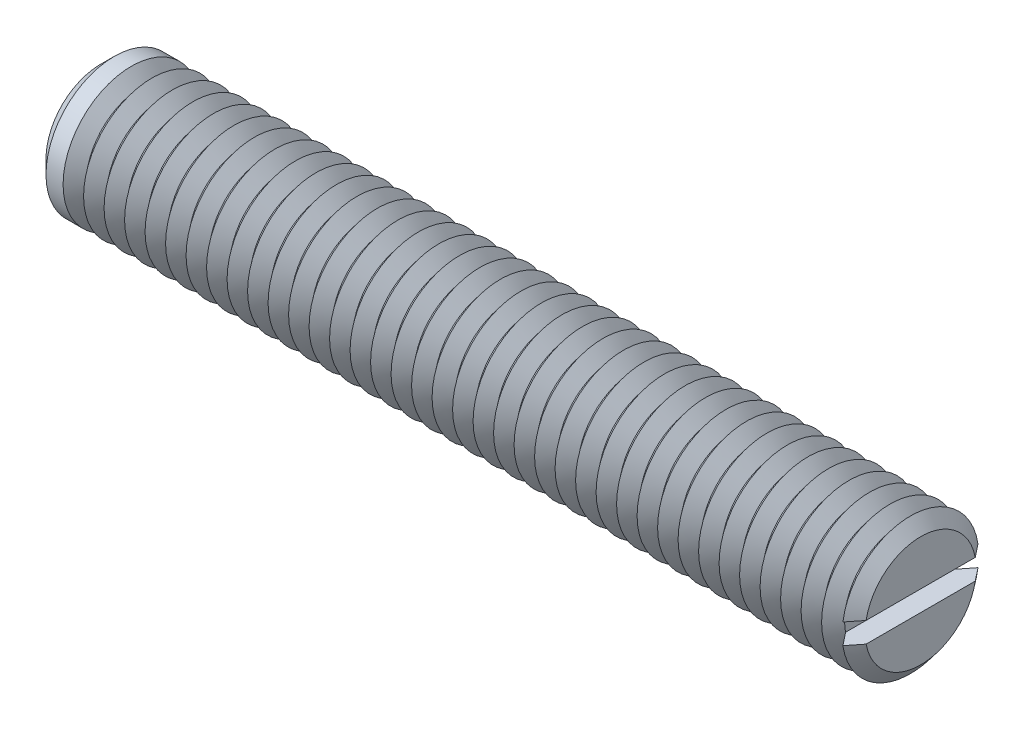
ISO-10303-21;
HEADER;
FILE_DESCRIPTION(('STEP AP214'),'2;1');
FILE_NAME('part.step','',(''),(''),'','','');
FILE_SCHEMA(('AUTOMOTIVE_DESIGN { 1 0 10303 214 1 1 1 1 }'));
ENDSEC;
DATA;
#1=APPLICATION_CONTEXT('core data for automotive mechanical design processes');
#2=APPLICATION_PROTOCOL_DEFINITION('international standard','automotive_design',2000,#1);
#3=PRODUCT_CONTEXT('',#1,'mechanical');
#4=PRODUCT('Part','Part','',(#3));
#5=PRODUCT_RELATED_PRODUCT_CATEGORY('part','',(#4));
#6=PRODUCT_DEFINITION_FORMATION('','',#4);
#7=PRODUCT_DEFINITION_CONTEXT('part definition',#1,'design');
#8=PRODUCT_DEFINITION('design','',#6,#7);
#9=PRODUCT_DEFINITION_SHAPE('','',#8);
#10=(LENGTH_UNIT() NAMED_UNIT(*) SI_UNIT(.MILLI.,.METRE.));
#11=(NAMED_UNIT(*) PLANE_ANGLE_UNIT() SI_UNIT($,.RADIAN.));
#12=(NAMED_UNIT(*) SI_UNIT($,.STERADIAN.) SOLID_ANGLE_UNIT());
#13=UNCERTAINTY_MEASURE_WITH_UNIT(LENGTH_MEASURE(1.E-05),#10,'distance_accuracy_value','');
#14=(GEOMETRIC_REPRESENTATION_CONTEXT(3) GLOBAL_UNCERTAINTY_ASSIGNED_CONTEXT((#13)) GLOBAL_UNIT_ASSIGNED_CONTEXT((#10,
#11,#12)) REPRESENTATION_CONTEXT('',''));
#15=CARTESIAN_POINT('',(0.,0.,0.));
#16=DIRECTION('',(0.,0.,1.));
#17=DIRECTION('',(1.,0.,0.));
#18=AXIS2_PLACEMENT_3D('',#15,#16,#17);
#19=CARTESIAN_POINT('',(29.25,0.,0.));
#20=DIRECTION('',(1.,0.,0.));
#21=DIRECTION('',(0.,0.,-1.));
#22=AXIS2_PLACEMENT_3D('',#19,#20,#21);
#23=CONICAL_SURFACE('',#22,5.,0.895664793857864);
#24=CARTESIAN_POINT('',(29.25,0.,0.));
#25=DIRECTION('',(-1.,0.,0.));
#26=DIRECTION('',(0.,0.,1.));
#27=AXIS2_PLACEMENT_3D('',#24,#25,#26);
#28=CIRCLE('',#27,5.);
#29=CARTESIAN_POINT('',(29.25,-0.75,-4.9434299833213));
#30=VERTEX_POINT('',#29);
#31=CARTESIAN_POINT('',(29.25,-0.75,4.9434299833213));
#32=VERTEX_POINT('',#31);
#33=EDGE_CURVE('E117',#30,#32,#28,.T.);
#34=ORIENTED_EDGE('',*,*,#33,.T.);
#35=CARTESIAN_POINT('',(33.9886555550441,-0.75,-10.8927895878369));
#36=CARTESIAN_POINT('',(33.678663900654,-0.75,-10.5046848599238));
#37=CARTESIAN_POINT('',(33.3687121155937,-0.75,-10.1165482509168));
#38=CARTESIAN_POINT('',(32.7489116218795,-0.75,-9.34012563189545));
#39=CARTESIAN_POINT('',(32.4390629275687,-0.75,-8.95183961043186));
#40=CARTESIAN_POINT('',(31.8189382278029,-0.75,-8.17433811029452));
#41=CARTESIAN_POINT('',(31.5086626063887,-0.75,-7.78512232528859));
#42=CARTESIAN_POINT('',(30.8884400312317,-0.75,-7.00649525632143));
#43=CARTESIAN_POINT('',(30.5784930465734,-0.75,-6.61708399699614));
#44=CARTESIAN_POINT('',(30.1053943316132,-0.75,-6.02191131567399));
#45=CARTESIAN_POINT('',(29.9420627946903,-0.75,-5.81629283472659));
#46=CARTESIAN_POINT('',(29.6155893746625,-0.75,-5.40490151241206));
#47=CARTESIAN_POINT('',(29.4524474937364,-0.75,-5.19912866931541));
#48=CARTESIAN_POINT('',(29.1263799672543,-0.75,-4.78730226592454));
#49=CARTESIAN_POINT('',(28.9634544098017,-0.75,-4.58124863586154));
#50=CARTESIAN_POINT('',(28.638006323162,-0.75,-4.16883695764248));
#51=CARTESIAN_POINT('',(28.4754837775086,-0.75,-3.96247892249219));
#52=CARTESIAN_POINT('',(28.1512888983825,-0.75,-3.54956515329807));
#53=CARTESIAN_POINT('',(27.9896156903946,-0.75,-3.34301010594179));
#54=CARTESIAN_POINT('',(27.6672688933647,-0.75,-2.92906737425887));
#55=CARTESIAN_POINT('',(27.5065954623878,-0.75,-2.72167956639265));
#56=CARTESIAN_POINT('',(27.2671162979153,-0.75,-2.40952296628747));
#57=CARTESIAN_POINT('',(27.187569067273,-0.75,-2.30532351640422));
#58=CARTESIAN_POINT('',(27.0292089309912,-0.75,-2.09636868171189));
#59=CARTESIAN_POINT('',(26.9503960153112,-0.75,-1.99161330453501));
#60=CARTESIAN_POINT('',(26.7939159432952,-0.75,-1.78128982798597));
#61=CARTESIAN_POINT('',(26.7162485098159,-0.75,-1.67572193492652));
#62=CARTESIAN_POINT('',(26.5627483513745,-0.75,-1.46326300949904));
#63=CARTESIAN_POINT('',(26.4869154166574,-0.75,-1.35637213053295));
#64=CARTESIAN_POINT('',(26.3961291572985,-0.75,-1.22407390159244));
#65=CARTESIAN_POINT('',(26.3795740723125,-0.75,-1.19976686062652));
#66=CARTESIAN_POINT('',(26.3466682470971,-0.75,-1.15101442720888));
#67=CARTESIAN_POINT('',(26.3303175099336,-0.75,-1.12656903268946));
#68=CARTESIAN_POINT('',(26.2816161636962,-0.75,-1.05299302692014));
#69=CARTESIAN_POINT('',(26.2496192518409,-0.75,-1.00362669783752));
#70=CARTESIAN_POINT('',(26.1868890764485,-0.75,-0.903957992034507));
#71=CARTESIAN_POINT('',(26.1561584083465,-0.75,-0.853653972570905));
#72=CARTESIAN_POINT('',(26.0966309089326,-0.75,-0.751913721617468));
#73=CARTESIAN_POINT('',(26.0678337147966,-0.75,-0.700477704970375));
#74=CARTESIAN_POINT('',(26.0225435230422,-0.75,-0.613963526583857));
#75=CARTESIAN_POINT('',(26.0052186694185,-0.75,-0.579327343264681));
#76=CARTESIAN_POINT('',(25.9722687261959,-0.75,-0.509265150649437));
#77=CARTESIAN_POINT('',(25.9566439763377,-0.75,-0.473838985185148));
#78=CARTESIAN_POINT('',(25.9132659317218,-0.75,-0.366382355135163));
#79=CARTESIAN_POINT('',(25.8888237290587,-0.75,-0.29284290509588));
#80=CARTESIAN_POINT('',(25.8658405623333,-0.75,-0.189809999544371));
#81=CARTESIAN_POINT('',(25.8606856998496,-0.75,-0.161782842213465));
#82=CARTESIAN_POINT('',(25.8527704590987,-0.75,-0.105398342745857));
#83=CARTESIAN_POINT('',(25.8500088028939,-0.75,-0.077041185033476));
#84=CARTESIAN_POINT('',(25.8470684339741,-0.75,-0.0202548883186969));
#85=CARTESIAN_POINT('',(25.8468839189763,-0.75,0.00817394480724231));
#86=CARTESIAN_POINT('',(25.8490950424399,-0.75,0.0649322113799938));
#87=CARTESIAN_POINT('',(25.851491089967,-0.75,0.0932616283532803));
#88=CARTESIAN_POINT('',(25.8596937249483,-0.75,0.157351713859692));
#89=CARTESIAN_POINT('',(25.8662565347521,-0.75,0.19301541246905));
#90=CARTESIAN_POINT('',(25.8827020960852,-0.75,0.263573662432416));
#91=CARTESIAN_POINT('',(25.8925874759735,-0.75,0.298467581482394));
#92=CARTESIAN_POINT('',(25.9150598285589,-0.75,0.3676520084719));
#93=CARTESIAN_POINT('',(25.9276667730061,-0.75,0.401935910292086));
#94=CARTESIAN_POINT('',(25.9549130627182,-0.75,0.469664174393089));
#95=CARTESIAN_POINT('',(25.9695519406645,-0.75,0.503108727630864));
#96=CARTESIAN_POINT('',(26.0166350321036,-0.75,0.604259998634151));
#97=CARTESIAN_POINT('',(26.051542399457,-0.75,0.670810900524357));
#98=CARTESIAN_POINT('',(26.1250588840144,-0.75,0.80184992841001));
#99=CARTESIAN_POINT('',(26.1636717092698,-0.75,0.866335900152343));
#100=CARTESIAN_POINT('',(26.2432739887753,-0.75,0.994050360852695));
#101=CARTESIAN_POINT('',(26.2842693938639,-0.75,1.05727512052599));
#102=CARTESIAN_POINT('',(26.3677403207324,-0.75,1.18274150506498));
#103=CARTESIAN_POINT('',(26.4102160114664,-0.75,1.24498301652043));
#104=CARTESIAN_POINT('',(26.4963066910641,-0.75,1.36895722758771));
#105=CARTESIAN_POINT('',(26.5399248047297,-0.75,1.43068775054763));
#106=CARTESIAN_POINT('',(26.6278819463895,-0.75,1.55364126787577));
#107=CARTESIAN_POINT('',(26.672221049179,-0.75,1.61486420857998));
#108=CARTESIAN_POINT('',(26.7613408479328,-0.75,1.73681254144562));
#109=CARTESIAN_POINT('',(26.8061205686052,-0.75,1.79753864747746));
#110=CARTESIAN_POINT('',(26.8960732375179,-0.75,1.91869503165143));
#111=CARTESIAN_POINT('',(26.9412461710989,-0.75,1.97912532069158));
#112=CARTESIAN_POINT('',(27.076109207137,-0.75,2.1586036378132));
#113=CARTESIAN_POINT('',(27.1662359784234,-0.75,2.27732336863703));
#114=CARTESIAN_POINT('',(27.3472315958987,-0.75,2.51419617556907));
#115=CARTESIAN_POINT('',(27.4381004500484,-0.75,2.63234924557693));
#116=CARTESIAN_POINT('',(27.7114512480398,-0.75,2.98624879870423));
#117=CARTESIAN_POINT('',(27.8946699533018,-0.75,3.22142577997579));
#118=CARTESIAN_POINT('',(28.262238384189,-0.75,3.69117947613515));
#119=CARTESIAN_POINT('',(28.4465888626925,-0.75,3.92575559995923));
#120=CARTESIAN_POINT('',(28.81587911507,-0.75,4.39443534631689));
#121=CARTESIAN_POINT('',(29.000818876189,-0.75,4.6285389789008));
#122=CARTESIAN_POINT('',(29.3703317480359,-0.75,5.09551589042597));
#123=CARTESIAN_POINT('',(29.5549033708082,-0.75,5.32839034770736));
#124=CARTESIAN_POINT('',(29.9242990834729,-0.75,5.79394105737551));
#125=CARTESIAN_POINT('',(30.1091231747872,-0.75,6.02661730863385));
#126=CARTESIAN_POINT('',(30.6637745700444,-0.75,6.72433690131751));
#127=CARTESIAN_POINT('',(31.0338620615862,-0.75,7.18917337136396));
#128=CARTESIAN_POINT('',(31.6190458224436,-0.75,7.9235623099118));
#129=CARTESIAN_POINT('',(31.8340169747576,-0.75,8.19321453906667));
#130=CARTESIAN_POINT('',(32.2640698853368,-0.75,8.73245662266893));
#131=CARTESIAN_POINT('',(32.4791516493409,-0.75,9.00204647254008));
#132=CARTESIAN_POINT('',(32.9099436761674,-0.75,9.54186292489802));
#133=CARTESIAN_POINT('',(33.1256541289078,-0.75,9.81208937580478));
#134=CARTESIAN_POINT('',(33.5571210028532,-0.75,10.3524795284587));
#135=CARTESIAN_POINT('',(33.7728774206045,-0.75,10.6226432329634));
#136=CARTESIAN_POINT('',(33.9886555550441,-0.75,10.8927895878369));
#137=B_SPLINE_CURVE_WITH_KNOTS('',3,(#35,#36,#37,#38,#39,#40,#41,#42,#43,#44,#45,#46,#47,#48,
#49,#50,#51,#52,#53,#54,#55,#56,#57,#58,#59,#60,#61,#62,#63,#64,#65,#66,#67,#68,#69,#70,#71,#72,
#73,#74,#75,#76,#77,#78,#79,#80,#81,#82,#83,#84,#85,#86,#87,#88,#89,#90,#91,#92,#93,#94,#95,#96,
#97,#98,#99,#100,#101,#102,#103,#104,#105,#106,#107,#108,#109,#110,#111,#112,#113,#114,#115,
#116,#117,#118,#119,#120,#121,#122,#123,#124,#125,#126,#127,#128,#129,#130,#131,#132,#133,#134,
#135,#136),.UNSPECIFIED.,.F.,.F.,(4,2,2,2,2,2,2,2,2,2,2,2,2,2,2,2,2,2,2,2,2,2,2,2,2,2,2,2,2,2,2,
2,2,2,2,2,2,2,2,2,2,2,2,2,2,2,2,2,2,2,4),(0.,1.49012787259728,2.98041311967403,4.47367759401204,
5.96678625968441,6.75457128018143,7.54236526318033,8.33041673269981,9.11843545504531,
9.90534542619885,10.6923767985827,11.0856530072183,11.4789238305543,11.8720978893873,
12.265226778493,12.3534535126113,12.441681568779,12.6181526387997,12.7949690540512,
12.9717521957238,13.0878863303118,13.2040436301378,13.43522465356,13.5206311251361,
13.605991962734,13.6911605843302,13.7763427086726,13.8849305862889,13.9936045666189,
14.1031049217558,14.2125801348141,14.4377857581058,14.6632191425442,14.8892420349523,
15.1152908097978,15.3420406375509,15.5688141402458,15.795165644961,16.0215087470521,
16.4686664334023,16.91582892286,17.8101909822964,18.7052318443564,19.6002534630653,
20.4916985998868,21.3831487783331,23.1656575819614,24.2002223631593,25.2348477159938,
26.2721422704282,27.3093757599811),.UNSPECIFIED.);
#138=CARTESIAN_POINT('',(28.5,-0.75,3.99343248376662));
#139=VERTEX_POINT('',#138);
#140=EDGE_CURVE('E109',#139,#32,#137,.T.);
#141=ORIENTED_EDGE('',*,*,#140,.F.);
#142=CARTESIAN_POINT('',(28.5,0.,0.));
#143=DIRECTION('',(-1.,0.,0.));
#144=DIRECTION('',(0.,0.,1.));
#145=AXIS2_PLACEMENT_3D('',#142,#143,#144);
#146=CIRCLE('',#145,4.06325030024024);
#147=CARTESIAN_POINT('',(28.5,-0.75,-3.99343248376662));
#148=VERTEX_POINT('',#147);
#149=EDGE_CURVE('E527',#148,#139,#146,.T.);
#150=ORIENTED_EDGE('',*,*,#149,.F.);
#151=EDGE_CURVE('E58',#30,#148,#137,.T.);
#152=ORIENTED_EDGE('',*,*,#151,.F.);
#153=EDGE_LOOP('',(#34,#141,#150,#152));
#154=FACE_BOUND('',#153,.T.);
#155=ADVANCED_FACE('F37',(#154),#23,.T.);
#156=CARTESIAN_POINT('',(29.25,0.75,4.9434299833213));
#157=VERTEX_POINT('',#156);
#158=CARTESIAN_POINT('',(29.25,0.75,-4.9434299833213));
#159=VERTEX_POINT('',#158);
#160=EDGE_CURVE('E100',#157,#159,#28,.T.);
#161=ORIENTED_EDGE('',*,*,#160,.T.);
#162=CARTESIAN_POINT('',(33.9886555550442,0.75,10.8927895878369));
#163=CARTESIAN_POINT('',(33.678663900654,0.75,10.5046848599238));
#164=CARTESIAN_POINT('',(33.3687121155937,0.75,10.1165482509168));
#165=CARTESIAN_POINT('',(32.7489116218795,0.75,9.34012563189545));
#166=CARTESIAN_POINT('',(32.4390629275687,0.75,8.95183961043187));
#167=CARTESIAN_POINT('',(31.8189382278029,0.75,8.17433811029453));
#168=CARTESIAN_POINT('',(31.5086626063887,0.75,7.7851223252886));
#169=CARTESIAN_POINT('',(30.8884400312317,0.75,7.00649525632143));
#170=CARTESIAN_POINT('',(30.5784930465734,0.75,6.61708399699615));
#171=CARTESIAN_POINT('',(30.1053943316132,0.75,6.021911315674));
#172=CARTESIAN_POINT('',(29.9420627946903,0.75,5.8162928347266));
#173=CARTESIAN_POINT('',(29.6155893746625,0.75,5.40490151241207));
#174=CARTESIAN_POINT('',(29.4524474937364,0.75,5.19912866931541));
#175=CARTESIAN_POINT('',(29.1263799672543,0.75,4.78730226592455));
#176=CARTESIAN_POINT('',(28.9634544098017,0.75,4.58124863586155));
#177=CARTESIAN_POINT('',(28.638006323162,0.75,4.16883695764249));
#178=CARTESIAN_POINT('',(28.4754837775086,0.75,3.9624789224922));
#179=CARTESIAN_POINT('',(28.1512888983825,0.75,3.54956515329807));
#180=CARTESIAN_POINT('',(27.9896156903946,0.75,3.3430101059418));
#181=CARTESIAN_POINT('',(27.6672688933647,0.75,2.92906737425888));
#182=CARTESIAN_POINT('',(27.5065954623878,0.75,2.72167956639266));
#183=CARTESIAN_POINT('',(27.2671162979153,0.75,2.40952296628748));
#184=CARTESIAN_POINT('',(27.187569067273,0.75,2.30532351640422));
#185=CARTESIAN_POINT('',(27.0292089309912,0.75,2.09636868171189));
#186=CARTESIAN_POINT('',(26.9503960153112,0.75,1.99161330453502));
#187=CARTESIAN_POINT('',(26.7939159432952,0.75,1.78128982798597));
#188=CARTESIAN_POINT('',(26.7162485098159,0.75,1.67572193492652));
#189=CARTESIAN_POINT('',(26.5627483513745,0.75,1.46326300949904));
#190=CARTESIAN_POINT('',(26.4869154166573,0.75,1.35637213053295));
#191=CARTESIAN_POINT('',(26.3961291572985,0.75,1.22407390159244));
#192=CARTESIAN_POINT('',(26.3795740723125,0.75,1.19976686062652));
#193=CARTESIAN_POINT('',(26.3466682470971,0.75,1.15101442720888));
#194=CARTESIAN_POINT('',(26.3303175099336,0.75,1.12656903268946));
#195=CARTESIAN_POINT('',(26.2816161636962,0.75,1.05299302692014));
#196=CARTESIAN_POINT('',(26.2496192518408,0.75,1.00362669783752));
#197=CARTESIAN_POINT('',(26.1868890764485,0.75,0.903957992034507));
#198=CARTESIAN_POINT('',(26.1561584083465,0.75,0.853653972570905));
#199=CARTESIAN_POINT('',(26.0966309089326,0.75,0.751913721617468));
#200=CARTESIAN_POINT('',(26.0678337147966,0.75,0.700477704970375));
#201=CARTESIAN_POINT('',(26.0225435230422,0.75,0.613963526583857));
#202=CARTESIAN_POINT('',(26.0052186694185,0.75,0.579327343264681));
#203=CARTESIAN_POINT('',(25.9722687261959,0.75,0.509265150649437));
#204=CARTESIAN_POINT('',(25.9566439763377,0.75,0.473838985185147));
#205=CARTESIAN_POINT('',(25.9132659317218,0.75,0.366382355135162));
#206=CARTESIAN_POINT('',(25.8888237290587,0.75,0.29284290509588));
#207=CARTESIAN_POINT('',(25.8658405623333,0.75,0.189809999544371));
#208=CARTESIAN_POINT('',(25.8606856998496,0.75,0.161782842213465));
#209=CARTESIAN_POINT('',(25.8527704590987,0.75,0.105398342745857));
#210=CARTESIAN_POINT('',(25.8500088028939,0.75,0.0770411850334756));
#211=CARTESIAN_POINT('',(25.8470684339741,0.75,0.0202548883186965));
#212=CARTESIAN_POINT('',(25.8468839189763,0.75,-0.00817394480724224));
#213=CARTESIAN_POINT('',(25.8490950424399,0.75,-0.0649322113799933));
#214=CARTESIAN_POINT('',(25.851491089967,0.75,-0.09326162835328));
#215=CARTESIAN_POINT('',(25.8596937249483,0.75,-0.157351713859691));
#216=CARTESIAN_POINT('',(25.8662565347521,0.75,-0.193015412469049));
#217=CARTESIAN_POINT('',(25.8827020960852,0.75,-0.263573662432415));
#218=CARTESIAN_POINT('',(25.8925874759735,0.75,-0.298467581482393));
#219=CARTESIAN_POINT('',(25.9150598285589,0.75,-0.3676520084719));
#220=CARTESIAN_POINT('',(25.9276667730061,0.75,-0.401935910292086));
#221=CARTESIAN_POINT('',(25.9549130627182,0.75,-0.469664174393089));
#222=CARTESIAN_POINT('',(25.9695519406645,0.75,-0.503108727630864));
#223=CARTESIAN_POINT('',(26.0166350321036,0.75,-0.60425999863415));
#224=CARTESIAN_POINT('',(26.051542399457,0.75,-0.670810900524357));
#225=CARTESIAN_POINT('',(26.1250588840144,0.75,-0.801849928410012));
#226=CARTESIAN_POINT('',(26.1636717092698,0.75,-0.866335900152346));
#227=CARTESIAN_POINT('',(26.2432739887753,0.75,-0.994050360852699));
#228=CARTESIAN_POINT('',(26.2842693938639,0.75,-1.05727512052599));
#229=CARTESIAN_POINT('',(26.3677403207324,0.75,-1.18274150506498));
#230=CARTESIAN_POINT('',(26.4102160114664,0.75,-1.24498301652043));
#231=CARTESIAN_POINT('',(26.4963066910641,0.75,-1.36895722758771));
#232=CARTESIAN_POINT('',(26.5399248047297,0.75,-1.43068775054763));
#233=CARTESIAN_POINT('',(26.6278819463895,0.75,-1.55364126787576));
#234=CARTESIAN_POINT('',(26.672221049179,0.75,-1.61486420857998));
#235=CARTESIAN_POINT('',(26.7613408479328,0.75,-1.73681254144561));
#236=CARTESIAN_POINT('',(26.8061205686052,0.75,-1.79753864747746));
#237=CARTESIAN_POINT('',(26.8960732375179,0.75,-1.91869503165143));
#238=CARTESIAN_POINT('',(26.9412461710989,0.75,-1.97912532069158));
#239=CARTESIAN_POINT('',(27.076109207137,0.75,-2.1586036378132));
#240=CARTESIAN_POINT('',(27.1662359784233,0.75,-2.27732336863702));
#241=CARTESIAN_POINT('',(27.3472315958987,0.75,-2.51419617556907));
#242=CARTESIAN_POINT('',(27.4381004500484,0.75,-2.63234924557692));
#243=CARTESIAN_POINT('',(27.7114512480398,0.75,-2.98624879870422));
#244=CARTESIAN_POINT('',(27.8946699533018,0.75,-3.22142577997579));
#245=CARTESIAN_POINT('',(28.262238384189,0.75,-3.69117947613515));
#246=CARTESIAN_POINT('',(28.4465888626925,0.75,-3.92575559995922));
#247=CARTESIAN_POINT('',(28.81587911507,0.75,-4.39443534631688));
#248=CARTESIAN_POINT('',(29.000818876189,0.75,-4.62853897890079));
#249=CARTESIAN_POINT('',(29.3703317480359,0.75,-5.09551589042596));
#250=CARTESIAN_POINT('',(29.5549033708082,0.75,-5.32839034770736));
#251=CARTESIAN_POINT('',(29.9242990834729,0.75,-5.7939410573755));
#252=CARTESIAN_POINT('',(30.1091231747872,0.75,-6.02661730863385));
#253=CARTESIAN_POINT('',(30.6637745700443,0.75,-6.72433690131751));
#254=CARTESIAN_POINT('',(31.0338620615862,0.75,-7.18917337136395));
#255=CARTESIAN_POINT('',(31.6190458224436,0.75,-7.9235623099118));
#256=CARTESIAN_POINT('',(31.8340169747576,0.75,-8.19321453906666));
#257=CARTESIAN_POINT('',(32.2640698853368,0.75,-8.73245662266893));
#258=CARTESIAN_POINT('',(32.4791516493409,0.75,-9.00204647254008));
#259=CARTESIAN_POINT('',(32.9099436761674,0.75,-9.54186292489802));
#260=CARTESIAN_POINT('',(33.1256541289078,0.75,-9.81208937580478));
#261=CARTESIAN_POINT('',(33.5571210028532,0.75,-10.3524795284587));
#262=CARTESIAN_POINT('',(33.7728774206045,0.75,-10.6226432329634));
#263=CARTESIAN_POINT('',(33.9886555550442,0.75,-10.8927895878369));
#264=B_SPLINE_CURVE_WITH_KNOTS('',3,(#162,#163,#164,#165,#166,#167,#168,#169,#170,#171,#172,
#173,#174,#175,#176,#177,#178,#179,#180,#181,#182,#183,#184,#185,#186,#187,#188,#189,#190,#191,
#192,#193,#194,#195,#196,#197,#198,#199,#200,#201,#202,#203,#204,#205,#206,#207,#208,#209,#210,
#211,#212,#213,#214,#215,#216,#217,#218,#219,#220,#221,#222,#223,#224,#225,#226,#227,#228,#229,
#230,#231,#232,#233,#234,#235,#236,#237,#238,#239,#240,#241,#242,#243,#244,#245,#246,#247,#248,
#249,#250,#251,#252,#253,#254,#255,#256,#257,#258,#259,#260,#261,#262,#263),.UNSPECIFIED.,.F.,
.F.,(4,2,2,2,2,2,2,2,2,2,2,2,2,2,2,2,2,2,2,2,2,2,2,2,2,2,2,2,2,2,2,2,2,2,2,2,2,2,2,2,2,2,2,2,2,
2,2,2,2,2,4),(0.,1.49012787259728,2.98041311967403,4.47367759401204,5.96678625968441,
6.75457128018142,7.54236526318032,8.33041673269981,9.11843545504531,9.90534542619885,
10.6923767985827,11.0856530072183,11.4789238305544,11.8720978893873,12.265226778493,
12.3534535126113,12.441681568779,12.6181526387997,12.7949690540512,12.9717521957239,
13.0878863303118,13.2040436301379,13.43522465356,13.5206311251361,13.6059919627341,
13.6911605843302,13.7763427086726,13.8849305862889,13.9936045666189,14.1031049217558,
14.2125801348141,14.4377857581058,14.6632191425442,14.8892420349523,15.1152908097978,
15.3420406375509,15.5688141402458,15.795165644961,16.0215087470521,16.4686664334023,
16.91582892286,17.8101909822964,18.7052318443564,19.6002534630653,20.4916985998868,
21.3831487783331,23.1656575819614,24.2002223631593,25.2348477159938,26.2721422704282,
27.3093757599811),.UNSPECIFIED.);
#265=CARTESIAN_POINT('',(28.5,0.75,-3.99343248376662));
#266=VERTEX_POINT('',#265);
#267=EDGE_CURVE('E110',#266,#159,#264,.T.);
#268=ORIENTED_EDGE('',*,*,#267,.F.);
#269=CARTESIAN_POINT('',(28.5,0.75,3.99343248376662));
#270=VERTEX_POINT('',#269);
#271=EDGE_CURVE('E103',#270,#266,#146,.T.);
#272=ORIENTED_EDGE('',*,*,#271,.F.);
#273=EDGE_CURVE('E97',#157,#270,#264,.T.);
#274=ORIENTED_EDGE('',*,*,#273,.F.);
#275=EDGE_LOOP('',(#161,#268,#272,#274));
#276=FACE_BOUND('',#275,.T.);
#277=ADVANCED_FACE('F99',(#276),#23,.T.);
#278=CARTESIAN_POINT('',(28.5,0.,0.));
#279=DIRECTION('',(-1.,0.,0.));
#280=DIRECTION('',(0.,0.,1.));
#281=AXIS2_PLACEMENT_3D('',#278,#279,#280);
#282=CONICAL_SURFACE('',#281,4.06325030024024,0.895664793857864);
#283=CARTESIAN_POINT('',(27.75,0.,0.));
#284=DIRECTION('',(-1.,0.,0.));
#285=DIRECTION('',(0.,0.,1.));
#286=AXIS2_PLACEMENT_3D('',#283,#284,#285);
#287=CIRCLE('',#286,5.);
#288=CARTESIAN_POINT('',(27.75,0.,5.));
#289=VERTEX_POINT('',#288);
#290=EDGE_CURVE('E513',#289,#289,#287,.T.);
#291=ORIENTED_EDGE('',*,*,#290,.F.);
#292=EDGE_LOOP('',(#291));
#293=FACE_BOUND('',#292,.T.);
#294=ORIENTED_EDGE('',*,*,#271,.T.);
#295=EDGE_CURVE('E522',#266,#148,#146,.T.);
#296=ORIENTED_EDGE('',*,*,#295,.T.);
#297=ORIENTED_EDGE('',*,*,#149,.T.);
#298=EDGE_CURVE('E520',#139,#270,#146,.T.);
#299=ORIENTED_EDGE('',*,*,#298,.T.);
#300=EDGE_LOOP('',(#294,#296,#297,#299));
#301=FACE_BOUND('',#300,.T.);
#302=ADVANCED_FACE('F168',(#293,#301),#282,.T.);
#303=CARTESIAN_POINT('',(30.,0.,0.));
#304=DIRECTION('',(1.,0.,0.));
#305=DIRECTION('',(0.,0.,-1.));
#306=AXIS2_PLACEMENT_3D('',#303,#304,#305);
#307=PLANE('',#306);
#308=CARTESIAN_POINT('',(30.,0.,0.));
#309=DIRECTION('',(-1.,0.,0.));
#310=DIRECTION('',(0.,0.,1.));
#311=AXIS2_PLACEMENT_3D('',#308,#309,#310);
#312=CIRCLE('',#311,4.06325030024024);
#313=CARTESIAN_POINT('',(30.,0.75,3.99343248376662));
#314=VERTEX_POINT('',#313);
#315=CARTESIAN_POINT('',(30.,0.75,-3.99343248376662));
#316=VERTEX_POINT('',#315);
#317=EDGE_CURVE('E160',#314,#316,#312,.T.);
#318=ORIENTED_EDGE('',*,*,#317,.F.);
#319=DIRECTION('',(0.,0.,1.));
#320=VECTOR('',#319,1.);
#321=CARTESIAN_POINT('',(30.,0.75,0.));
#322=LINE('',#321,#320);
#323=EDGE_CURVE('E122',#316,#314,#322,.T.);
#324=ORIENTED_EDGE('',*,*,#323,.F.);
#325=EDGE_LOOP('',(#318,#324));
#326=FACE_BOUND('',#325,.T.);
#327=ADVANCED_FACE('F172',(#326),#307,.T.);
#328=CARTESIAN_POINT('',(30.,-0.75,-3.99343248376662));
#329=VERTEX_POINT('',#328);
#330=CARTESIAN_POINT('',(30.,-0.75,3.99343248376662));
#331=VERTEX_POINT('',#330);
#332=EDGE_CURVE('E66',#329,#331,#312,.T.);
#333=ORIENTED_EDGE('',*,*,#332,.F.);
#334=DIRECTION('',(0.,0.,-1.));
#335=VECTOR('',#334,1.);
#336=CARTESIAN_POINT('',(30.,-0.75,0.));
#337=LINE('',#336,#335);
#338=EDGE_CURVE('E136',#331,#329,#337,.T.);
#339=ORIENTED_EDGE('',*,*,#338,.F.);
#340=EDGE_LOOP('',(#333,#339));
#341=FACE_BOUND('',#340,.T.);
#342=ADVANCED_FACE('F198',(#341),#307,.T.);
#343=CARTESIAN_POINT('',(30.,0.,0.));
#344=DIRECTION('',(-1.,0.,0.));
#345=DIRECTION('',(0.,0.,1.));
#346=AXIS2_PLACEMENT_3D('',#343,#344,#345);
#347=CONICAL_SURFACE('',#346,4.06325030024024,0.895664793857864);
#348=ORIENTED_EDGE('',*,*,#160,.F.);
#349=CARTESIAN_POINT('',(24.5113444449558,0.75,-10.8927895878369));
#350=CARTESIAN_POINT('',(24.821336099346,0.75,-10.5046848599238));
#351=CARTESIAN_POINT('',(25.1312878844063,0.75,-10.1165482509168));
#352=CARTESIAN_POINT('',(25.7510883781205,0.75,-9.34012563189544));
#353=CARTESIAN_POINT('',(26.0609370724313,0.75,-8.95183961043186));
#354=CARTESIAN_POINT('',(26.6810617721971,0.75,-8.17433811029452));
#355=CARTESIAN_POINT('',(26.9913373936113,0.75,-7.78512232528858));
#356=CARTESIAN_POINT('',(27.6115599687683,0.75,-7.00649525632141));
#357=CARTESIAN_POINT('',(27.9215069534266,0.75,-6.61708399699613));
#358=CARTESIAN_POINT('',(28.3946056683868,0.75,-6.02191131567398));
#359=CARTESIAN_POINT('',(28.5579372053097,0.75,-5.81629283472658));
#360=CARTESIAN_POINT('',(28.8844106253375,0.75,-5.40490151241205));
#361=CARTESIAN_POINT('',(29.0475525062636,0.75,-5.1991286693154));
#362=CARTESIAN_POINT('',(29.3736200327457,0.75,-4.78730226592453));
#363=CARTESIAN_POINT('',(29.5365455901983,0.75,-4.58124863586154));
#364=CARTESIAN_POINT('',(29.861993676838,0.75,-4.16883695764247));
#365=CARTESIAN_POINT('',(30.0245162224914,0.75,-3.96247892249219));
#366=CARTESIAN_POINT('',(30.3487111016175,0.75,-3.54956515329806));
#367=CARTESIAN_POINT('',(30.5103843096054,0.75,-3.34301010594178));
#368=CARTESIAN_POINT('',(30.8327311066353,0.75,-2.92906737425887));
#369=CARTESIAN_POINT('',(30.9934045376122,0.75,-2.72167956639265));
#370=CARTESIAN_POINT('',(31.2328837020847,0.75,-2.40952296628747));
#371=CARTESIAN_POINT('',(31.312430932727,0.75,-2.30532351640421));
#372=CARTESIAN_POINT('',(31.4707910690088,0.75,-2.09636868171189));
#373=CARTESIAN_POINT('',(31.5496039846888,0.75,-1.99161330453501));
#374=CARTESIAN_POINT('',(31.7060840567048,0.75,-1.78128982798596));
#375=CARTESIAN_POINT('',(31.7837514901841,0.75,-1.67572193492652));
#376=CARTESIAN_POINT('',(31.9372516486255,0.75,-1.46326300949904));
#377=CARTESIAN_POINT('',(32.0130845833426,0.75,-1.35637213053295));
#378=CARTESIAN_POINT('',(32.1038708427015,0.75,-1.22407390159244));
#379=CARTESIAN_POINT('',(32.1204259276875,0.75,-1.19976686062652));
#380=CARTESIAN_POINT('',(32.1533317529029,0.75,-1.15101442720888));
#381=CARTESIAN_POINT('',(32.1696824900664,0.75,-1.12656903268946));
#382=CARTESIAN_POINT('',(32.2183838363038,0.75,-1.05299302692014));
#383=CARTESIAN_POINT('',(32.2503807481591,0.75,-1.00362669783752));
#384=CARTESIAN_POINT('',(32.3131109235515,0.75,-0.903957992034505));
#385=CARTESIAN_POINT('',(32.3438415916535,0.75,-0.8536539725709));
#386=CARTESIAN_POINT('',(32.4033690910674,0.75,-0.751913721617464));
#387=CARTESIAN_POINT('',(32.4321662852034,0.75,-0.700477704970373));
#388=CARTESIAN_POINT('',(32.4774564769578,0.75,-0.613963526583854));
#389=CARTESIAN_POINT('',(32.4947813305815,0.75,-0.579327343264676));
#390=CARTESIAN_POINT('',(32.5277312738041,0.75,-0.509265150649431));
#391=CARTESIAN_POINT('',(32.5433560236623,0.75,-0.473838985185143));
#392=CARTESIAN_POINT('',(32.5867340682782,0.75,-0.366382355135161));
#393=CARTESIAN_POINT('',(32.6111762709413,0.75,-0.292842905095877));
#394=CARTESIAN_POINT('',(32.6341594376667,0.75,-0.189809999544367));
#395=CARTESIAN_POINT('',(32.6393143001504,0.75,-0.161782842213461));
#396=CARTESIAN_POINT('',(32.6472295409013,0.75,-0.105398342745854));
#397=CARTESIAN_POINT('',(32.6499911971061,0.75,-0.0770411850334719));
#398=CARTESIAN_POINT('',(32.6529315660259,0.75,-0.0202548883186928));
#399=CARTESIAN_POINT('',(32.6531160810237,0.75,0.00817394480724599));
#400=CARTESIAN_POINT('',(32.6509049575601,0.75,0.0649322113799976));
#401=CARTESIAN_POINT('',(32.648508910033,0.75,0.0932616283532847));
#402=CARTESIAN_POINT('',(32.6403062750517,0.75,0.157351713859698));
#403=CARTESIAN_POINT('',(32.6337434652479,0.75,0.193015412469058));
#404=CARTESIAN_POINT('',(32.6172979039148,0.75,0.263573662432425));
#405=CARTESIAN_POINT('',(32.6074125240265,0.75,0.298467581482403));
#406=CARTESIAN_POINT('',(32.5849401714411,0.75,0.367652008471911));
#407=CARTESIAN_POINT('',(32.5723332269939,0.75,0.401935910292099));
#408=CARTESIAN_POINT('',(32.5450869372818,0.75,0.469664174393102));
#409=CARTESIAN_POINT('',(32.5304480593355,0.75,0.503108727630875));
#410=CARTESIAN_POINT('',(32.4833649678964,0.75,0.60425999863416));
#411=CARTESIAN_POINT('',(32.448457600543,0.75,0.670810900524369));
#412=CARTESIAN_POINT('',(32.3749411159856,0.75,0.801849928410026));
#413=CARTESIAN_POINT('',(32.3363282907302,0.75,0.866335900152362));
#414=CARTESIAN_POINT('',(32.2567260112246,0.75,0.99405036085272));
#415=CARTESIAN_POINT('',(32.215730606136,0.75,1.05727512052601));
#416=CARTESIAN_POINT('',(32.1322596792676,0.75,1.18274150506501));
#417=CARTESIAN_POINT('',(32.0897839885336,0.75,1.24498301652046));
#418=CARTESIAN_POINT('',(32.0036933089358,0.75,1.36895722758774));
#419=CARTESIAN_POINT('',(31.9600751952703,0.75,1.43068775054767));
#420=CARTESIAN_POINT('',(31.8721180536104,0.75,1.55364126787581));
#421=CARTESIAN_POINT('',(31.827778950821,0.75,1.61486420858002));
#422=CARTESIAN_POINT('',(31.7386591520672,0.75,1.73681254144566));
#423=CARTESIAN_POINT('',(31.6938794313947,0.75,1.79753864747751));
#424=CARTESIAN_POINT('',(31.6039267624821,0.75,1.91869503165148));
#425=CARTESIAN_POINT('',(31.558753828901,0.75,1.97912532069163));
#426=CARTESIAN_POINT('',(31.4238907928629,0.75,2.15860363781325));
#427=CARTESIAN_POINT('',(31.3337640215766,0.75,2.27732336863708));
#428=CARTESIAN_POINT('',(31.1527684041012,0.75,2.51419617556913));
#429=CARTESIAN_POINT('',(31.0618995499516,0.75,2.63234924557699));
#430=CARTESIAN_POINT('',(30.7885487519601,0.75,2.98624879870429));
#431=CARTESIAN_POINT('',(30.6053300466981,0.75,3.22142577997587));
#432=CARTESIAN_POINT('',(30.237761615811,0.75,3.69117947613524));
#433=CARTESIAN_POINT('',(30.0534111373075,0.75,3.92575559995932));
#434=CARTESIAN_POINT('',(29.6841208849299,0.75,4.39443534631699));
#435=CARTESIAN_POINT('',(29.4991811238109,0.75,4.62853897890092));
#436=CARTESIAN_POINT('',(29.1296682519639,0.75,5.0955158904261));
#437=CARTESIAN_POINT('',(28.9450966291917,0.75,5.3283903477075));
#438=CARTESIAN_POINT('',(28.575700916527,0.75,5.79394105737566));
#439=CARTESIAN_POINT('',(28.3908768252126,0.75,6.02661730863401));
#440=CARTESIAN_POINT('',(27.8362254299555,0.75,6.72433690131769));
#441=CARTESIAN_POINT('',(27.4661379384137,0.75,7.18917337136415));
#442=CARTESIAN_POINT('',(26.8809541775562,0.75,7.92356230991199));
#443=CARTESIAN_POINT('',(26.6659830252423,0.75,8.19321453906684));
#444=CARTESIAN_POINT('',(26.2359301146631,0.75,8.73245662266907));
#445=CARTESIAN_POINT('',(26.020848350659,0.75,9.0020464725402));
#446=CARTESIAN_POINT('',(25.5900563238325,0.75,9.54186292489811));
#447=CARTESIAN_POINT('',(25.3743458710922,0.75,9.81208937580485));
#448=CARTESIAN_POINT('',(24.9428789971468,0.75,10.3524795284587));
#449=CARTESIAN_POINT('',(24.7271225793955,0.75,10.6226432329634));
#450=CARTESIAN_POINT('',(24.5113444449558,0.75,10.8927895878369));
#451=B_SPLINE_CURVE_WITH_KNOTS('',3,(#349,#350,#351,#352,#353,#354,#355,#356,#357,#358,#359,
#360,#361,#362,#363,#364,#365,#366,#367,#368,#369,#370,#371,#372,#373,#374,#375,#376,#377,#378,
#379,#380,#381,#382,#383,#384,#385,#386,#387,#388,#389,#390,#391,#392,#393,#394,#395,#396,#397,
#398,#399,#400,#401,#402,#403,#404,#405,#406,#407,#408,#409,#410,#411,#412,#413,#414,#415,#416,
#417,#418,#419,#420,#421,#422,#423,#424,#425,#426,#427,#428,#429,#430,#431,#432,#433,#434,#435,
#436,#437,#438,#439,#440,#441,#442,#443,#444,#445,#446,#447,#448,#449,#450),.UNSPECIFIED.,.F.,
.F.,(4,2,2,2,2,2,2,2,2,2,2,2,2,2,2,2,2,2,2,2,2,2,2,2,2,2,2,2,2,2,2,2,2,2,2,2,2,2,2,2,2,2,2,2,2,
2,2,2,2,2,4),(0.,1.49012787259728,2.98041311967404,4.47367759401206,5.96678625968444,
6.75457128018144,7.54236526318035,8.33041673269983,9.11843545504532,9.90534542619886,
10.6923767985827,11.0856530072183,11.4789238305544,11.8720978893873,12.265226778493,
12.3534535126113,12.441681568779,12.6181526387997,12.7949690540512,12.9717521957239,
13.0878863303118,13.2040436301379,13.43522465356,13.5206311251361,13.6059919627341,
13.6911605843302,13.7763427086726,13.8849305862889,13.993604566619,14.1031049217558,
14.2125801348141,14.4377857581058,14.6632191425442,14.8892420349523,15.1152908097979,
15.3420406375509,15.5688141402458,15.7951656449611,16.0215087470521,16.4686664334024,
16.9158289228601,17.8101909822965,18.7052318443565,19.6002534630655,20.491698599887,
21.3831487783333,23.1656575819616,24.2002223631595,25.2348477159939,26.2721422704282,
27.3093757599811),.UNSPECIFIED.);
#452=EDGE_CURVE('E41',#314,#157,#451,.T.);
#453=ORIENTED_EDGE('',*,*,#452,.F.);
#454=ORIENTED_EDGE('',*,*,#317,.T.);
#455=EDGE_CURVE('E11',#159,#316,#451,.T.);
#456=ORIENTED_EDGE('',*,*,#455,.F.);
#457=EDGE_LOOP('',(#348,#453,#454,#456));
#458=FACE_BOUND('',#457,.T.);
#459=ADVANCED_FACE('F114',(#458),#347,.T.);
#460=CARTESIAN_POINT('',(30.,0.75,-7.5));
#461=DIRECTION('',(0.,1.,0.));
#462=DIRECTION('',(0.,0.,1.));
#463=AXIS2_PLACEMENT_3D('',#460,#461,#462);
#464=PLANE('',#463);
#465=ORIENTED_EDGE('',*,*,#452,.T.);
#466=ORIENTED_EDGE('',*,*,#273,.T.);
#467=DIRECTION('',(0.,0.,1.));
#468=VECTOR('',#467,1.);
#469=CARTESIAN_POINT('',(28.5,0.75,-7.5));
#470=LINE('',#469,#468);
#471=EDGE_CURVE('E145',#266,#270,#470,.T.);
#472=ORIENTED_EDGE('',*,*,#471,.F.);
#473=ORIENTED_EDGE('',*,*,#267,.T.);
#474=ORIENTED_EDGE('',*,*,#455,.T.);
#475=ORIENTED_EDGE('',*,*,#323,.T.);
#476=EDGE_LOOP('',(#465,#466,#472,#473,#474,#475));
#477=FACE_BOUND('',#476,.T.);
#478=ADVANCED_FACE('F120',(#477),#464,.F.);
#479=ORIENTED_EDGE('',*,*,#33,.F.);
#480=CARTESIAN_POINT('',(24.5113444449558,-0.75,10.8927895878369));
#481=CARTESIAN_POINT('',(24.821336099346,-0.75,10.5046848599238));
#482=CARTESIAN_POINT('',(25.1312878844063,-0.75,10.1165482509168));
#483=CARTESIAN_POINT('',(25.7510883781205,-0.75,9.34012563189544));
#484=CARTESIAN_POINT('',(26.0609370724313,-0.75,8.95183961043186));
#485=CARTESIAN_POINT('',(26.6810617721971,-0.75,8.17433811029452));
#486=CARTESIAN_POINT('',(26.9913373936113,-0.75,7.78512232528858));
#487=CARTESIAN_POINT('',(27.6115599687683,-0.75,7.00649525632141));
#488=CARTESIAN_POINT('',(27.9215069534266,-0.75,6.61708399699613));
#489=CARTESIAN_POINT('',(28.3946056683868,-0.75,6.02191131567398));
#490=CARTESIAN_POINT('',(28.5579372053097,-0.75,5.81629283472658));
#491=CARTESIAN_POINT('',(28.8844106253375,-0.75,5.40490151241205));
#492=CARTESIAN_POINT('',(29.0475525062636,-0.75,5.1991286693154));
#493=CARTESIAN_POINT('',(29.3736200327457,-0.75,4.78730226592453));
#494=CARTESIAN_POINT('',(29.5365455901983,-0.75,4.58124863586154));
#495=CARTESIAN_POINT('',(29.861993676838,-0.75,4.16883695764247));
#496=CARTESIAN_POINT('',(30.0245162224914,-0.75,3.96247892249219));
#497=CARTESIAN_POINT('',(30.3487111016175,-0.75,3.54956515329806));
#498=CARTESIAN_POINT('',(30.5103843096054,-0.75,3.34301010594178));
#499=CARTESIAN_POINT('',(30.8327311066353,-0.75,2.92906737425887));
#500=CARTESIAN_POINT('',(30.9934045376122,-0.75,2.72167956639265));
#501=CARTESIAN_POINT('',(31.2328837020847,-0.75,2.40952296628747));
#502=CARTESIAN_POINT('',(31.312430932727,-0.75,2.30532351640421));
#503=CARTESIAN_POINT('',(31.4707910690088,-0.75,2.09636868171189));
#504=CARTESIAN_POINT('',(31.5496039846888,-0.75,1.99161330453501));
#505=CARTESIAN_POINT('',(31.7060840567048,-0.75,1.78128982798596));
#506=CARTESIAN_POINT('',(31.7837514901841,-0.75,1.67572193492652));
#507=CARTESIAN_POINT('',(31.9372516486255,-0.75,1.46326300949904));
#508=CARTESIAN_POINT('',(32.0130845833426,-0.75,1.35637213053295));
#509=CARTESIAN_POINT('',(32.1038708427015,-0.75,1.22407390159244));
#510=CARTESIAN_POINT('',(32.1204259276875,-0.75,1.19976686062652));
#511=CARTESIAN_POINT('',(32.1533317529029,-0.75,1.15101442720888));
#512=CARTESIAN_POINT('',(32.1696824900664,-0.75,1.12656903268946));
#513=CARTESIAN_POINT('',(32.2183838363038,-0.75,1.05299302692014));
#514=CARTESIAN_POINT('',(32.2503807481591,-0.75,1.00362669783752));
#515=CARTESIAN_POINT('',(32.3131109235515,-0.75,0.903957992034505));
#516=CARTESIAN_POINT('',(32.3438415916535,-0.75,0.8536539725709));
#517=CARTESIAN_POINT('',(32.4033690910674,-0.75,0.751913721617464));
#518=CARTESIAN_POINT('',(32.4321662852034,-0.75,0.700477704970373));
#519=CARTESIAN_POINT('',(32.4774564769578,-0.75,0.613963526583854));
#520=CARTESIAN_POINT('',(32.4947813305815,-0.75,0.579327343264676));
#521=CARTESIAN_POINT('',(32.5277312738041,-0.75,0.509265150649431));
#522=CARTESIAN_POINT('',(32.5433560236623,-0.75,0.473838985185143));
#523=CARTESIAN_POINT('',(32.5867340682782,-0.75,0.366382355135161));
#524=CARTESIAN_POINT('',(32.6111762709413,-0.75,0.292842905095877));
#525=CARTESIAN_POINT('',(32.6341594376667,-0.75,0.189809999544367));
#526=CARTESIAN_POINT('',(32.6393143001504,-0.75,0.161782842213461));
#527=CARTESIAN_POINT('',(32.6472295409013,-0.75,0.105398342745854));
#528=CARTESIAN_POINT('',(32.6499911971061,-0.75,0.0770411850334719));
#529=CARTESIAN_POINT('',(32.6529315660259,-0.75,0.0202548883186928));
#530=CARTESIAN_POINT('',(32.6531160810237,-0.75,-0.00817394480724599));
#531=CARTESIAN_POINT('',(32.6509049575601,-0.75,-0.0649322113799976));
#532=CARTESIAN_POINT('',(32.648508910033,-0.75,-0.0932616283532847));
#533=CARTESIAN_POINT('',(32.6403062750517,-0.75,-0.157351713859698));
#534=CARTESIAN_POINT('',(32.6337434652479,-0.75,-0.193015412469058));
#535=CARTESIAN_POINT('',(32.6172979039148,-0.75,-0.263573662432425));
#536=CARTESIAN_POINT('',(32.6074125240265,-0.75,-0.298467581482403));
#537=CARTESIAN_POINT('',(32.5849401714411,-0.75,-0.367652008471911));
#538=CARTESIAN_POINT('',(32.5723332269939,-0.75,-0.401935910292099));
#539=CARTESIAN_POINT('',(32.5450869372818,-0.75,-0.469664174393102));
#540=CARTESIAN_POINT('',(32.5304480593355,-0.75,-0.503108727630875));
#541=CARTESIAN_POINT('',(32.4833649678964,-0.75,-0.60425999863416));
#542=CARTESIAN_POINT('',(32.448457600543,-0.75,-0.670810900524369));
#543=CARTESIAN_POINT('',(32.3749411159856,-0.75,-0.801849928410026));
#544=CARTESIAN_POINT('',(32.3363282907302,-0.75,-0.866335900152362));
#545=CARTESIAN_POINT('',(32.2567260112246,-0.75,-0.99405036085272));
#546=CARTESIAN_POINT('',(32.215730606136,-0.75,-1.05727512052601));
#547=CARTESIAN_POINT('',(32.1322596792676,-0.75,-1.18274150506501));
#548=CARTESIAN_POINT('',(32.0897839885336,-0.75,-1.24498301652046));
#549=CARTESIAN_POINT('',(32.0036933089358,-0.75,-1.36895722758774));
#550=CARTESIAN_POINT('',(31.9600751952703,-0.75,-1.43068775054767));
#551=CARTESIAN_POINT('',(31.8721180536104,-0.75,-1.55364126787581));
#552=CARTESIAN_POINT('',(31.827778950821,-0.75,-1.61486420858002));
#553=CARTESIAN_POINT('',(31.7386591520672,-0.75,-1.73681254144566));
#554=CARTESIAN_POINT('',(31.6938794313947,-0.75,-1.79753864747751));
#555=CARTESIAN_POINT('',(31.6039267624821,-0.75,-1.91869503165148));
#556=CARTESIAN_POINT('',(31.558753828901,-0.75,-1.97912532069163));
#557=CARTESIAN_POINT('',(31.4238907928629,-0.75,-2.15860363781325));
#558=CARTESIAN_POINT('',(31.3337640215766,-0.75,-2.27732336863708));
#559=CARTESIAN_POINT('',(31.1527684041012,-0.75,-2.51419617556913));
#560=CARTESIAN_POINT('',(31.0618995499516,-0.75,-2.63234924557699));
#561=CARTESIAN_POINT('',(30.7885487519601,-0.75,-2.98624879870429));
#562=CARTESIAN_POINT('',(30.6053300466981,-0.75,-3.22142577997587));
#563=CARTESIAN_POINT('',(30.237761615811,-0.75,-3.69117947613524));
#564=CARTESIAN_POINT('',(30.0534111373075,-0.75,-3.92575559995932));
#565=CARTESIAN_POINT('',(29.6841208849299,-0.75,-4.39443534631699));
#566=CARTESIAN_POINT('',(29.4991811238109,-0.75,-4.62853897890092));
#567=CARTESIAN_POINT('',(29.1296682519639,-0.75,-5.0955158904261));
#568=CARTESIAN_POINT('',(28.9450966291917,-0.75,-5.3283903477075));
#569=CARTESIAN_POINT('',(28.575700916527,-0.75,-5.79394105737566));
#570=CARTESIAN_POINT('',(28.3908768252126,-0.75,-6.02661730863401));
#571=CARTESIAN_POINT('',(27.8362254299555,-0.75,-6.72433690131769));
#572=CARTESIAN_POINT('',(27.4661379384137,-0.75,-7.18917337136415));
#573=CARTESIAN_POINT('',(26.8809541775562,-0.75,-7.92356230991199));
#574=CARTESIAN_POINT('',(26.6659830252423,-0.75,-8.19321453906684));
#575=CARTESIAN_POINT('',(26.2359301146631,-0.75,-8.73245662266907));
#576=CARTESIAN_POINT('',(26.020848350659,-0.75,-9.0020464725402));
#577=CARTESIAN_POINT('',(25.5900563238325,-0.75,-9.54186292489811));
#578=CARTESIAN_POINT('',(25.3743458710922,-0.75,-9.81208937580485));
#579=CARTESIAN_POINT('',(24.9428789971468,-0.75,-10.3524795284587));
#580=CARTESIAN_POINT('',(24.7271225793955,-0.75,-10.6226432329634));
#581=CARTESIAN_POINT('',(24.5113444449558,-0.75,-10.8927895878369));
#582=B_SPLINE_CURVE_WITH_KNOTS('',3,(#480,#481,#482,#483,#484,#485,#486,#487,#488,#489,#490,
#491,#492,#493,#494,#495,#496,#497,#498,#499,#500,#501,#502,#503,#504,#505,#506,#507,#508,#509,
#510,#511,#512,#513,#514,#515,#516,#517,#518,#519,#520,#521,#522,#523,#524,#525,#526,#527,#528,
#529,#530,#531,#532,#533,#534,#535,#536,#537,#538,#539,#540,#541,#542,#543,#544,#545,#546,#547,
#548,#549,#550,#551,#552,#553,#554,#555,#556,#557,#558,#559,#560,#561,#562,#563,#564,#565,#566,
#567,#568,#569,#570,#571,#572,#573,#574,#575,#576,#577,#578,#579,#580,#581),.UNSPECIFIED.,.F.,
.F.,(4,2,2,2,2,2,2,2,2,2,2,2,2,2,2,2,2,2,2,2,2,2,2,2,2,2,2,2,2,2,2,2,2,2,2,2,2,2,2,2,2,2,2,2,2,
2,2,2,2,2,4),(0.,1.49012787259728,2.98041311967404,4.47367759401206,5.96678625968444,
6.75457128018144,7.54236526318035,8.33041673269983,9.11843545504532,9.90534542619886,
10.6923767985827,11.0856530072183,11.4789238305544,11.8720978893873,12.265226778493,
12.3534535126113,12.441681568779,12.6181526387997,12.7949690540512,12.9717521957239,
13.0878863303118,13.2040436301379,13.43522465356,13.5206311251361,13.6059919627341,
13.6911605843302,13.7763427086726,13.8849305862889,13.993604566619,14.1031049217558,
14.2125801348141,14.4377857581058,14.6632191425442,14.8892420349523,15.1152908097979,
15.3420406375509,15.5688141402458,15.7951656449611,16.0215087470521,16.4686664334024,
16.9158289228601,17.8101909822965,18.7052318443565,19.6002534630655,20.491698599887,
21.3831487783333,23.1656575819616,24.2002223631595,25.2348477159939,26.2721422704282,
27.3093757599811),.UNSPECIFIED.);
#583=EDGE_CURVE('E152',#329,#30,#582,.T.);
#584=ORIENTED_EDGE('',*,*,#583,.F.);
#585=ORIENTED_EDGE('',*,*,#332,.T.);
#586=EDGE_CURVE('E148',#32,#331,#582,.T.);
#587=ORIENTED_EDGE('',*,*,#586,.F.);
#588=EDGE_LOOP('',(#479,#584,#585,#587));
#589=FACE_BOUND('',#588,.T.);
#590=ADVANCED_FACE('F164',(#589),#347,.T.);
#591=CARTESIAN_POINT('',(30.,-0.75,-7.5));
#592=DIRECTION('',(0.,-1.,0.));
#593=DIRECTION('',(0.,0.,-1.));
#594=AXIS2_PLACEMENT_3D('',#591,#592,#593);
#595=PLANE('',#594);
#596=ORIENTED_EDGE('',*,*,#583,.T.);
#597=ORIENTED_EDGE('',*,*,#151,.T.);
#598=DIRECTION('',(0.,0.,1.));
#599=VECTOR('',#598,1.);
#600=CARTESIAN_POINT('',(28.5,-0.75,-7.5));
#601=LINE('',#600,#599);
#602=EDGE_CURVE('E144',#148,#139,#601,.T.);
#603=ORIENTED_EDGE('',*,*,#602,.T.);
#604=ORIENTED_EDGE('',*,*,#140,.T.);
#605=ORIENTED_EDGE('',*,*,#586,.T.);
#606=ORIENTED_EDGE('',*,*,#338,.T.);
#607=EDGE_LOOP('',(#596,#597,#603,#604,#605,#606));
#608=FACE_BOUND('',#607,.T.);
#609=ADVANCED_FACE('F161',(#608),#595,.F.);
#610=CARTESIAN_POINT('',(28.5,0.75,-7.5));
#611=DIRECTION('',(-1.,0.,0.));
#612=DIRECTION('',(0.,0.,1.));
#613=AXIS2_PLACEMENT_3D('',#610,#611,#612);
#614=PLANE('',#613);
#615=ORIENTED_EDGE('',*,*,#602,.F.);
#616=ORIENTED_EDGE('',*,*,#295,.F.);
#617=ORIENTED_EDGE('',*,*,#471,.T.);
#618=ORIENTED_EDGE('',*,*,#298,.F.);
#619=EDGE_LOOP('',(#615,#616,#617,#618));
#620=FACE_BOUND('',#619,.T.);
#621=ADVANCED_FACE('F532',(#620),#614,.F.);
#622=CARTESIAN_POINT('',(27.,0.,0.));
#623=DIRECTION('',(-1.,0.,0.));
#624=DIRECTION('',(0.,0.,1.));
#625=AXIS2_PLACEMENT_3D('',#622,#623,#624);
#626=CONICAL_SURFACE('',#625,4.06325030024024,0.895664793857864);
#627=CARTESIAN_POINT('',(26.25,0.,0.));
#628=DIRECTION('',(-1.,0.,0.));
#629=DIRECTION('',(0.,0.,1.));
#630=AXIS2_PLACEMENT_3D('',#627,#628,#629);
#631=CIRCLE('',#630,5.);
#632=CARTESIAN_POINT('',(26.25,0.,5.));
#633=VERTEX_POINT('',#632);
#634=EDGE_CURVE('E505',#633,#633,#631,.T.);
#635=ORIENTED_EDGE('',*,*,#634,.F.);
#636=EDGE_LOOP('',(#635));
#637=FACE_BOUND('',#636,.T.);
#638=CARTESIAN_POINT('',(27.,0.,0.));
#639=DIRECTION('',(-1.,0.,0.));
#640=DIRECTION('',(0.,0.,1.));
#641=AXIS2_PLACEMENT_3D('',#638,#639,#640);
#642=CIRCLE('',#641,4.06325030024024);
#643=CARTESIAN_POINT('',(27.,0.,4.06325030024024));
#644=VERTEX_POINT('',#643);
#645=EDGE_CURVE('E517',#644,#644,#642,.T.);
#646=ORIENTED_EDGE('',*,*,#645,.T.);
#647=EDGE_LOOP('',(#646));
#648=FACE_BOUND('',#647,.T.);
#649=ADVANCED_FACE('F177',(#637,#648),#626,.T.);
#650=CARTESIAN_POINT('',(27.75,0.,0.));
#651=DIRECTION('',(1.,0.,0.));
#652=DIRECTION('',(0.,0.,-1.));
#653=AXIS2_PLACEMENT_3D('',#650,#651,#652);
#654=CONICAL_SURFACE('',#653,5.,0.895664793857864);
#655=ORIENTED_EDGE('',*,*,#645,.F.);
#656=EDGE_LOOP('',(#655));
#657=FACE_BOUND('',#656,.T.);
#658=ORIENTED_EDGE('',*,*,#290,.T.);
#659=EDGE_LOOP('',(#658));
#660=FACE_BOUND('',#659,.T.);
#661=ADVANCED_FACE('F538',(#657,#660),#654,.T.);
#662=CARTESIAN_POINT('',(25.5,0.,0.));
#663=DIRECTION('',(-1.,0.,0.));
#664=DIRECTION('',(0.,0.,1.));
#665=AXIS2_PLACEMENT_3D('',#662,#663,#664);
#666=CONICAL_SURFACE('',#665,4.06325030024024,0.895664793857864);
#667=CARTESIAN_POINT('',(24.75,0.,0.));
#668=DIRECTION('',(-1.,0.,0.));
#669=DIRECTION('',(0.,0.,1.));
#670=AXIS2_PLACEMENT_3D('',#667,#668,#669);
#671=CIRCLE('',#670,5.);
#672=CARTESIAN_POINT('',(24.75,0.,5.));
#673=VERTEX_POINT('',#672);
#674=EDGE_CURVE('E497',#673,#673,#671,.T.);
#675=ORIENTED_EDGE('',*,*,#674,.F.);
#676=EDGE_LOOP('',(#675));
#677=FACE_BOUND('',#676,.T.);
#678=CARTESIAN_POINT('',(25.5,0.,0.));
#679=DIRECTION('',(-1.,0.,0.));
#680=DIRECTION('',(0.,0.,1.));
#681=AXIS2_PLACEMENT_3D('',#678,#679,#680);
#682=CIRCLE('',#681,4.06325030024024);
#683=CARTESIAN_POINT('',(25.5,0.,4.06325030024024));
#684=VERTEX_POINT('',#683);
#685=EDGE_CURVE('E509',#684,#684,#682,.T.);
#686=ORIENTED_EDGE('',*,*,#685,.T.);
#687=EDGE_LOOP('',(#686));
#688=FACE_BOUND('',#687,.T.);
#689=ADVANCED_FACE('F602',(#677,#688),#666,.T.);
#690=CARTESIAN_POINT('',(26.25,0.,0.));
#691=DIRECTION('',(1.,0.,0.));
#692=DIRECTION('',(0.,0.,-1.));
#693=AXIS2_PLACEMENT_3D('',#690,#691,#692);
#694=CONICAL_SURFACE('',#693,5.,0.895664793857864);
#695=ORIENTED_EDGE('',*,*,#685,.F.);
#696=EDGE_LOOP('',(#695));
#697=FACE_BOUND('',#696,.T.);
#698=ORIENTED_EDGE('',*,*,#634,.T.);
#699=EDGE_LOOP('',(#698));
#700=FACE_BOUND('',#699,.T.);
#701=ADVANCED_FACE('F611',(#697,#700),#694,.T.);
#702=CARTESIAN_POINT('',(24.,0.,0.));
#703=DIRECTION('',(-1.,0.,0.));
#704=DIRECTION('',(0.,0.,1.));
#705=AXIS2_PLACEMENT_3D('',#702,#703,#704);
#706=CONICAL_SURFACE('',#705,4.06325030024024,0.895664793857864);
#707=CARTESIAN_POINT('',(23.25,0.,0.));
#708=DIRECTION('',(-1.,0.,0.));
#709=DIRECTION('',(0.,0.,1.));
#710=AXIS2_PLACEMENT_3D('',#707,#708,#709);
#711=CIRCLE('',#710,5.);
#712=CARTESIAN_POINT('',(23.25,0.,5.));
#713=VERTEX_POINT('',#712);
#714=EDGE_CURVE('E489',#713,#713,#711,.T.);
#715=ORIENTED_EDGE('',*,*,#714,.F.);
#716=EDGE_LOOP('',(#715));
#717=FACE_BOUND('',#716,.T.);
#718=CARTESIAN_POINT('',(24.,0.,0.));
#719=DIRECTION('',(-1.,0.,0.));
#720=DIRECTION('',(0.,0.,1.));
#721=AXIS2_PLACEMENT_3D('',#718,#719,#720);
#722=CIRCLE('',#721,4.06325030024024);
#723=CARTESIAN_POINT('',(24.,0.,4.06325030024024));
#724=VERTEX_POINT('',#723);
#725=EDGE_CURVE('E501',#724,#724,#722,.T.);
#726=ORIENTED_EDGE('',*,*,#725,.T.);
#727=EDGE_LOOP('',(#726));
#728=FACE_BOUND('',#727,.T.);
#729=ADVANCED_FACE('F621',(#717,#728),#706,.T.);
#730=CARTESIAN_POINT('',(24.75,0.,0.));
#731=DIRECTION('',(1.,0.,0.));
#732=DIRECTION('',(0.,0.,-1.));
#733=AXIS2_PLACEMENT_3D('',#730,#731,#732);
#734=CONICAL_SURFACE('',#733,5.,0.895664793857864);
#735=ORIENTED_EDGE('',*,*,#725,.F.);
#736=EDGE_LOOP('',(#735));
#737=FACE_BOUND('',#736,.T.);
#738=ORIENTED_EDGE('',*,*,#674,.T.);
#739=EDGE_LOOP('',(#738));
#740=FACE_BOUND('',#739,.T.);
#741=ADVANCED_FACE('F631',(#737,#740),#734,.T.);
#742=CARTESIAN_POINT('',(22.5,0.,0.));
#743=DIRECTION('',(-1.,0.,0.));
#744=DIRECTION('',(0.,0.,1.));
#745=AXIS2_PLACEMENT_3D('',#742,#743,#744);
#746=CONICAL_SURFACE('',#745,4.06325030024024,0.895664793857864);
#747=CARTESIAN_POINT('',(21.75,0.,0.));
#748=DIRECTION('',(-1.,0.,0.));
#749=DIRECTION('',(0.,0.,1.));
#750=AXIS2_PLACEMENT_3D('',#747,#748,#749);
#751=CIRCLE('',#750,5.);
#752=CARTESIAN_POINT('',(21.75,0.,5.));
#753=VERTEX_POINT('',#752);
#754=EDGE_CURVE('E481',#753,#753,#751,.T.);
#755=ORIENTED_EDGE('',*,*,#754,.F.);
#756=EDGE_LOOP('',(#755));
#757=FACE_BOUND('',#756,.T.);
#758=CARTESIAN_POINT('',(22.5,0.,0.));
#759=DIRECTION('',(-1.,0.,0.));
#760=DIRECTION('',(0.,0.,1.));
#761=AXIS2_PLACEMENT_3D('',#758,#759,#760);
#762=CIRCLE('',#761,4.06325030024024);
#763=CARTESIAN_POINT('',(22.5,0.,4.06325030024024));
#764=VERTEX_POINT('',#763);
#765=EDGE_CURVE('E493',#764,#764,#762,.T.);
#766=ORIENTED_EDGE('',*,*,#765,.T.);
#767=EDGE_LOOP('',(#766));
#768=FACE_BOUND('',#767,.T.);
#769=ADVANCED_FACE('F641',(#757,#768),#746,.T.);
#770=CARTESIAN_POINT('',(23.25,0.,0.));
#771=DIRECTION('',(1.,0.,0.));
#772=DIRECTION('',(0.,0.,-1.));
#773=AXIS2_PLACEMENT_3D('',#770,#771,#772);
#774=CONICAL_SURFACE('',#773,5.,0.895664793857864);
#775=ORIENTED_EDGE('',*,*,#765,.F.);
#776=EDGE_LOOP('',(#775));
#777=FACE_BOUND('',#776,.T.);
#778=ORIENTED_EDGE('',*,*,#714,.T.);
#779=EDGE_LOOP('',(#778));
#780=FACE_BOUND('',#779,.T.);
#781=ADVANCED_FACE('F651',(#777,#780),#774,.T.);
#782=CARTESIAN_POINT('',(21.,0.,0.));
#783=DIRECTION('',(-1.,0.,0.));
#784=DIRECTION('',(0.,0.,1.));
#785=AXIS2_PLACEMENT_3D('',#782,#783,#784);
#786=CONICAL_SURFACE('',#785,4.06325030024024,0.895664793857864);
#787=CARTESIAN_POINT('',(20.25,0.,0.));
#788=DIRECTION('',(-1.,0.,0.));
#789=DIRECTION('',(0.,0.,1.));
#790=AXIS2_PLACEMENT_3D('',#787,#788,#789);
#791=CIRCLE('',#790,5.);
#792=CARTESIAN_POINT('',(20.25,0.,5.));
#793=VERTEX_POINT('',#792);
#794=EDGE_CURVE('E473',#793,#793,#791,.T.);
#795=ORIENTED_EDGE('',*,*,#794,.F.);
#796=EDGE_LOOP('',(#795));
#797=FACE_BOUND('',#796,.T.);
#798=CARTESIAN_POINT('',(21.,0.,0.));
#799=DIRECTION('',(-1.,0.,0.));
#800=DIRECTION('',(0.,0.,1.));
#801=AXIS2_PLACEMENT_3D('',#798,#799,#800);
#802=CIRCLE('',#801,4.06325030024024);
#803=CARTESIAN_POINT('',(21.,0.,4.06325030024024));
#804=VERTEX_POINT('',#803);
#805=EDGE_CURVE('E485',#804,#804,#802,.T.);
#806=ORIENTED_EDGE('',*,*,#805,.T.);
#807=EDGE_LOOP('',(#806));
#808=FACE_BOUND('',#807,.T.);
#809=ADVANCED_FACE('F661',(#797,#808),#786,.T.);
#810=CARTESIAN_POINT('',(21.75,0.,0.));
#811=DIRECTION('',(1.,0.,0.));
#812=DIRECTION('',(0.,0.,-1.));
#813=AXIS2_PLACEMENT_3D('',#810,#811,#812);
#814=CONICAL_SURFACE('',#813,5.,0.895664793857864);
#815=ORIENTED_EDGE('',*,*,#805,.F.);
#816=EDGE_LOOP('',(#815));
#817=FACE_BOUND('',#816,.T.);
#818=ORIENTED_EDGE('',*,*,#754,.T.);
#819=EDGE_LOOP('',(#818));
#820=FACE_BOUND('',#819,.T.);
#821=ADVANCED_FACE('F671',(#817,#820),#814,.T.);
#822=CARTESIAN_POINT('',(19.5,0.,0.));
#823=DIRECTION('',(-1.,0.,0.));
#824=DIRECTION('',(0.,0.,1.));
#825=AXIS2_PLACEMENT_3D('',#822,#823,#824);
#826=CONICAL_SURFACE('',#825,4.06325030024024,0.895664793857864);
#827=CARTESIAN_POINT('',(18.75,0.,0.));
#828=DIRECTION('',(-1.,0.,0.));
#829=DIRECTION('',(0.,0.,1.));
#830=AXIS2_PLACEMENT_3D('',#827,#828,#829);
#831=CIRCLE('',#830,5.);
#832=CARTESIAN_POINT('',(18.75,0.,5.));
#833=VERTEX_POINT('',#832);
#834=EDGE_CURVE('E465',#833,#833,#831,.T.);
#835=ORIENTED_EDGE('',*,*,#834,.F.);
#836=EDGE_LOOP('',(#835));
#837=FACE_BOUND('',#836,.T.);
#838=CARTESIAN_POINT('',(19.5,0.,0.));
#839=DIRECTION('',(-1.,0.,0.));
#840=DIRECTION('',(0.,0.,1.));
#841=AXIS2_PLACEMENT_3D('',#838,#839,#840);
#842=CIRCLE('',#841,4.06325030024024);
#843=CARTESIAN_POINT('',(19.5,0.,4.06325030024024));
#844=VERTEX_POINT('',#843);
#845=EDGE_CURVE('E477',#844,#844,#842,.T.);
#846=ORIENTED_EDGE('',*,*,#845,.T.);
#847=EDGE_LOOP('',(#846));
#848=FACE_BOUND('',#847,.T.);
#849=ADVANCED_FACE('F681',(#837,#848),#826,.T.);
#850=CARTESIAN_POINT('',(20.25,0.,0.));
#851=DIRECTION('',(1.,0.,0.));
#852=DIRECTION('',(0.,0.,-1.));
#853=AXIS2_PLACEMENT_3D('',#850,#851,#852);
#854=CONICAL_SURFACE('',#853,5.,0.895664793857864);
#855=ORIENTED_EDGE('',*,*,#845,.F.);
#856=EDGE_LOOP('',(#855));
#857=FACE_BOUND('',#856,.T.);
#858=ORIENTED_EDGE('',*,*,#794,.T.);
#859=EDGE_LOOP('',(#858));
#860=FACE_BOUND('',#859,.T.);
#861=ADVANCED_FACE('F691',(#857,#860),#854,.T.);
#862=CARTESIAN_POINT('',(18.,0.,0.));
#863=DIRECTION('',(-1.,0.,0.));
#864=DIRECTION('',(0.,0.,1.));
#865=AXIS2_PLACEMENT_3D('',#862,#863,#864);
#866=CONICAL_SURFACE('',#865,4.06325030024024,0.895664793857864);
#867=CARTESIAN_POINT('',(17.25,0.,0.));
#868=DIRECTION('',(-1.,0.,0.));
#869=DIRECTION('',(0.,0.,1.));
#870=AXIS2_PLACEMENT_3D('',#867,#868,#869);
#871=CIRCLE('',#870,5.);
#872=CARTESIAN_POINT('',(17.25,0.,5.));
#873=VERTEX_POINT('',#872);
#874=EDGE_CURVE('E458',#873,#873,#871,.T.);
#875=ORIENTED_EDGE('',*,*,#874,.F.);
#876=EDGE_LOOP('',(#875));
#877=FACE_BOUND('',#876,.T.);
#878=CARTESIAN_POINT('',(18.,0.,0.));
#879=DIRECTION('',(-1.,0.,0.));
#880=DIRECTION('',(0.,0.,1.));
#881=AXIS2_PLACEMENT_3D('',#878,#879,#880);
#882=CIRCLE('',#881,4.06325030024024);
#883=CARTESIAN_POINT('',(18.,0.,4.06325030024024));
#884=VERTEX_POINT('',#883);
#885=EDGE_CURVE('E469',#884,#884,#882,.T.);
#886=ORIENTED_EDGE('',*,*,#885,.T.);
#887=EDGE_LOOP('',(#886));
#888=FACE_BOUND('',#887,.T.);
#889=ADVANCED_FACE('F701',(#877,#888),#866,.T.);
#890=CARTESIAN_POINT('',(18.75,0.,0.));
#891=DIRECTION('',(1.,0.,0.));
#892=DIRECTION('',(0.,0.,-1.));
#893=AXIS2_PLACEMENT_3D('',#890,#891,#892);
#894=CONICAL_SURFACE('',#893,5.,0.895664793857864);
#895=ORIENTED_EDGE('',*,*,#885,.F.);
#896=EDGE_LOOP('',(#895));
#897=FACE_BOUND('',#896,.T.);
#898=ORIENTED_EDGE('',*,*,#834,.T.);
#899=EDGE_LOOP('',(#898));
#900=FACE_BOUND('',#899,.T.);
#901=ADVANCED_FACE('F711',(#897,#900),#894,.T.);
#902=CARTESIAN_POINT('',(16.5,0.,0.));
#903=DIRECTION('',(-1.,0.,0.));
#904=DIRECTION('',(0.,0.,1.));
#905=AXIS2_PLACEMENT_3D('',#902,#903,#904);
#906=CONICAL_SURFACE('',#905,4.06325030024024,0.895664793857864);
#907=CARTESIAN_POINT('',(15.75,0.,0.));
#908=DIRECTION('',(-1.,0.,0.));
#909=DIRECTION('',(0.,0.,1.));
#910=AXIS2_PLACEMENT_3D('',#907,#908,#909);
#911=CIRCLE('',#910,5.);
#912=CARTESIAN_POINT('',(15.75,0.,5.));
#913=VERTEX_POINT('',#912);
#914=EDGE_CURVE('E450',#913,#913,#911,.T.);
#915=ORIENTED_EDGE('',*,*,#914,.F.);
#916=EDGE_LOOP('',(#915));
#917=FACE_BOUND('',#916,.T.);
#918=CARTESIAN_POINT('',(16.5,0.,0.));
#919=DIRECTION('',(-1.,0.,0.));
#920=DIRECTION('',(0.,0.,1.));
#921=AXIS2_PLACEMENT_3D('',#918,#919,#920);
#922=CIRCLE('',#921,4.06325030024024);
#923=CARTESIAN_POINT('',(16.5,0.,4.06325030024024));
#924=VERTEX_POINT('',#923);
#925=EDGE_CURVE('E461',#924,#924,#922,.T.);
#926=ORIENTED_EDGE('',*,*,#925,.T.);
#927=EDGE_LOOP('',(#926));
#928=FACE_BOUND('',#927,.T.);
#929=ADVANCED_FACE('F721',(#917,#928),#906,.T.);
#930=CARTESIAN_POINT('',(17.25,0.,0.));
#931=DIRECTION('',(1.,0.,0.));
#932=DIRECTION('',(0.,0.,-1.));
#933=AXIS2_PLACEMENT_3D('',#930,#931,#932);
#934=CONICAL_SURFACE('',#933,5.,0.895664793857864);
#935=ORIENTED_EDGE('',*,*,#925,.F.);
#936=EDGE_LOOP('',(#935));
#937=FACE_BOUND('',#936,.T.);
#938=ORIENTED_EDGE('',*,*,#874,.T.);
#939=EDGE_LOOP('',(#938));
#940=FACE_BOUND('',#939,.T.);
#941=ADVANCED_FACE('F731',(#937,#940),#934,.T.);
#942=CARTESIAN_POINT('',(15.,0.,0.));
#943=DIRECTION('',(-1.,0.,0.));
#944=DIRECTION('',(0.,0.,1.));
#945=AXIS2_PLACEMENT_3D('',#942,#943,#944);
#946=CONICAL_SURFACE('',#945,4.06325030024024,0.895664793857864);
#947=CARTESIAN_POINT('',(14.25,0.,0.));
#948=DIRECTION('',(-1.,0.,0.));
#949=DIRECTION('',(0.,0.,1.));
#950=AXIS2_PLACEMENT_3D('',#947,#948,#949);
#951=CIRCLE('',#950,5.);
#952=CARTESIAN_POINT('',(14.25,0.,5.));
#953=VERTEX_POINT('',#952);
#954=EDGE_CURVE('E442',#953,#953,#951,.T.);
#955=ORIENTED_EDGE('',*,*,#954,.F.);
#956=EDGE_LOOP('',(#955));
#957=FACE_BOUND('',#956,.T.);
#958=CARTESIAN_POINT('',(15.,0.,0.));
#959=DIRECTION('',(-1.,0.,0.));
#960=DIRECTION('',(0.,0.,1.));
#961=AXIS2_PLACEMENT_3D('',#958,#959,#960);
#962=CIRCLE('',#961,4.06325030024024);
#963=CARTESIAN_POINT('',(15.,0.,4.06325030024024));
#964=VERTEX_POINT('',#963);
#965=EDGE_CURVE('E454',#964,#964,#962,.T.);
#966=ORIENTED_EDGE('',*,*,#965,.T.);
#967=EDGE_LOOP('',(#966));
#968=FACE_BOUND('',#967,.T.);
#969=ADVANCED_FACE('F741',(#957,#968),#946,.T.);
#970=CARTESIAN_POINT('',(15.75,0.,0.));
#971=DIRECTION('',(1.,0.,0.));
#972=DIRECTION('',(0.,0.,-1.));
#973=AXIS2_PLACEMENT_3D('',#970,#971,#972);
#974=CONICAL_SURFACE('',#973,5.,0.895664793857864);
#975=ORIENTED_EDGE('',*,*,#965,.F.);
#976=EDGE_LOOP('',(#975));
#977=FACE_BOUND('',#976,.T.);
#978=ORIENTED_EDGE('',*,*,#914,.T.);
#979=EDGE_LOOP('',(#978));
#980=FACE_BOUND('',#979,.T.);
#981=ADVANCED_FACE('F751',(#977,#980),#974,.T.);
#982=CARTESIAN_POINT('',(13.5,0.,0.));
#983=DIRECTION('',(-1.,0.,0.));
#984=DIRECTION('',(0.,0.,1.));
#985=AXIS2_PLACEMENT_3D('',#982,#983,#984);
#986=CONICAL_SURFACE('',#985,4.06325030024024,0.895664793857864);
#987=CARTESIAN_POINT('',(12.75,0.,0.));
#988=DIRECTION('',(-1.,0.,0.));
#989=DIRECTION('',(0.,0.,1.));
#990=AXIS2_PLACEMENT_3D('',#987,#988,#989);
#991=CIRCLE('',#990,5.);
#992=CARTESIAN_POINT('',(12.75,0.,5.));
#993=VERTEX_POINT('',#992);
#994=EDGE_CURVE('E434',#993,#993,#991,.T.);
#995=ORIENTED_EDGE('',*,*,#994,.F.);
#996=EDGE_LOOP('',(#995));
#997=FACE_BOUND('',#996,.T.);
#998=CARTESIAN_POINT('',(13.5,0.,0.));
#999=DIRECTION('',(-1.,0.,0.));
#1000=DIRECTION('',(0.,0.,1.));
#1001=AXIS2_PLACEMENT_3D('',#998,#999,#1000);
#1002=CIRCLE('',#1001,4.06325030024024);
#1003=CARTESIAN_POINT('',(13.5,0.,4.06325030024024));
#1004=VERTEX_POINT('',#1003);
#1005=EDGE_CURVE('E446',#1004,#1004,#1002,.T.);
#1006=ORIENTED_EDGE('',*,*,#1005,.T.);
#1007=EDGE_LOOP('',(#1006));
#1008=FACE_BOUND('',#1007,.T.);
#1009=ADVANCED_FACE('F761',(#997,#1008),#986,.T.);
#1010=CARTESIAN_POINT('',(14.25,0.,0.));
#1011=DIRECTION('',(1.,0.,0.));
#1012=DIRECTION('',(0.,0.,-1.));
#1013=AXIS2_PLACEMENT_3D('',#1010,#1011,#1012);
#1014=CONICAL_SURFACE('',#1013,5.,0.895664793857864);
#1015=ORIENTED_EDGE('',*,*,#1005,.F.);
#1016=EDGE_LOOP('',(#1015));
#1017=FACE_BOUND('',#1016,.T.);
#1018=ORIENTED_EDGE('',*,*,#954,.T.);
#1019=EDGE_LOOP('',(#1018));
#1020=FACE_BOUND('',#1019,.T.);
#1021=ADVANCED_FACE('F771',(#1017,#1020),#1014,.T.);
#1022=CARTESIAN_POINT('',(12.,0.,0.));
#1023=DIRECTION('',(-1.,0.,0.));
#1024=DIRECTION('',(0.,0.,1.));
#1025=AXIS2_PLACEMENT_3D('',#1022,#1023,#1024);
#1026=CONICAL_SURFACE('',#1025,4.06325030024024,0.895664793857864);
#1027=CARTESIAN_POINT('',(11.25,0.,0.));
#1028=DIRECTION('',(-1.,0.,0.));
#1029=DIRECTION('',(0.,0.,1.));
#1030=AXIS2_PLACEMENT_3D('',#1027,#1028,#1029);
#1031=CIRCLE('',#1030,5.);
#1032=CARTESIAN_POINT('',(11.25,0.,5.));
#1033=VERTEX_POINT('',#1032);
#1034=EDGE_CURVE('E426',#1033,#1033,#1031,.T.);
#1035=ORIENTED_EDGE('',*,*,#1034,.F.);
#1036=EDGE_LOOP('',(#1035));
#1037=FACE_BOUND('',#1036,.T.);
#1038=CARTESIAN_POINT('',(12.,0.,0.));
#1039=DIRECTION('',(-1.,0.,0.));
#1040=DIRECTION('',(0.,0.,1.));
#1041=AXIS2_PLACEMENT_3D('',#1038,#1039,#1040);
#1042=CIRCLE('',#1041,4.06325030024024);
#1043=CARTESIAN_POINT('',(12.,0.,4.06325030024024));
#1044=VERTEX_POINT('',#1043);
#1045=EDGE_CURVE('E438',#1044,#1044,#1042,.T.);
#1046=ORIENTED_EDGE('',*,*,#1045,.T.);
#1047=EDGE_LOOP('',(#1046));
#1048=FACE_BOUND('',#1047,.T.);
#1049=ADVANCED_FACE('F781',(#1037,#1048),#1026,.T.);
#1050=CARTESIAN_POINT('',(12.75,0.,0.));
#1051=DIRECTION('',(1.,0.,0.));
#1052=DIRECTION('',(0.,0.,-1.));
#1053=AXIS2_PLACEMENT_3D('',#1050,#1051,#1052);
#1054=CONICAL_SURFACE('',#1053,5.,0.895664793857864);
#1055=ORIENTED_EDGE('',*,*,#1045,.F.);
#1056=EDGE_LOOP('',(#1055));
#1057=FACE_BOUND('',#1056,.T.);
#1058=ORIENTED_EDGE('',*,*,#994,.T.);
#1059=EDGE_LOOP('',(#1058));
#1060=FACE_BOUND('',#1059,.T.);
#1061=ADVANCED_FACE('F791',(#1057,#1060),#1054,.T.);
#1062=CARTESIAN_POINT('',(10.5,0.,0.));
#1063=DIRECTION('',(-1.,0.,0.));
#1064=DIRECTION('',(0.,0.,1.));
#1065=AXIS2_PLACEMENT_3D('',#1062,#1063,#1064);
#1066=CONICAL_SURFACE('',#1065,4.06325030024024,0.895664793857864);
#1067=CARTESIAN_POINT('',(9.75,0.,0.));
#1068=DIRECTION('',(-1.,0.,0.));
#1069=DIRECTION('',(0.,0.,1.));
#1070=AXIS2_PLACEMENT_3D('',#1067,#1068,#1069);
#1071=CIRCLE('',#1070,5.);
#1072=CARTESIAN_POINT('',(9.75,0.,5.));
#1073=VERTEX_POINT('',#1072);
#1074=EDGE_CURVE('E418',#1073,#1073,#1071,.T.);
#1075=ORIENTED_EDGE('',*,*,#1074,.F.);
#1076=EDGE_LOOP('',(#1075));
#1077=FACE_BOUND('',#1076,.T.);
#1078=CARTESIAN_POINT('',(10.5,0.,0.));
#1079=DIRECTION('',(-1.,0.,0.));
#1080=DIRECTION('',(0.,0.,1.));
#1081=AXIS2_PLACEMENT_3D('',#1078,#1079,#1080);
#1082=CIRCLE('',#1081,4.06325030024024);
#1083=CARTESIAN_POINT('',(10.5,0.,4.06325030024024));
#1084=VERTEX_POINT('',#1083);
#1085=EDGE_CURVE('E430',#1084,#1084,#1082,.T.);
#1086=ORIENTED_EDGE('',*,*,#1085,.T.);
#1087=EDGE_LOOP('',(#1086));
#1088=FACE_BOUND('',#1087,.T.);
#1089=ADVANCED_FACE('F801',(#1077,#1088),#1066,.T.);
#1090=CARTESIAN_POINT('',(11.25,0.,0.));
#1091=DIRECTION('',(1.,0.,0.));
#1092=DIRECTION('',(0.,0.,-1.));
#1093=AXIS2_PLACEMENT_3D('',#1090,#1091,#1092);
#1094=CONICAL_SURFACE('',#1093,5.,0.895664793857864);
#1095=ORIENTED_EDGE('',*,*,#1085,.F.);
#1096=EDGE_LOOP('',(#1095));
#1097=FACE_BOUND('',#1096,.T.);
#1098=ORIENTED_EDGE('',*,*,#1034,.T.);
#1099=EDGE_LOOP('',(#1098));
#1100=FACE_BOUND('',#1099,.T.);
#1101=ADVANCED_FACE('F811',(#1097,#1100),#1094,.T.);
#1102=CARTESIAN_POINT('',(9.,0.,0.));
#1103=DIRECTION('',(-1.,0.,0.));
#1104=DIRECTION('',(0.,0.,1.));
#1105=AXIS2_PLACEMENT_3D('',#1102,#1103,#1104);
#1106=CONICAL_SURFACE('',#1105,4.06325030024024,0.895664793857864);
#1107=CARTESIAN_POINT('',(8.25,0.,0.));
#1108=DIRECTION('',(-1.,0.,0.));
#1109=DIRECTION('',(0.,0.,1.));
#1110=AXIS2_PLACEMENT_3D('',#1107,#1108,#1109);
#1111=CIRCLE('',#1110,5.);
#1112=CARTESIAN_POINT('',(8.25,0.,5.));
#1113=VERTEX_POINT('',#1112);
#1114=EDGE_CURVE('E410',#1113,#1113,#1111,.T.);
#1115=ORIENTED_EDGE('',*,*,#1114,.F.);
#1116=EDGE_LOOP('',(#1115));
#1117=FACE_BOUND('',#1116,.T.);
#1118=CARTESIAN_POINT('',(9.,0.,0.));
#1119=DIRECTION('',(-1.,0.,0.));
#1120=DIRECTION('',(0.,0.,1.));
#1121=AXIS2_PLACEMENT_3D('',#1118,#1119,#1120);
#1122=CIRCLE('',#1121,4.06325030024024);
#1123=CARTESIAN_POINT('',(9.,0.,4.06325030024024));
#1124=VERTEX_POINT('',#1123);
#1125=EDGE_CURVE('E422',#1124,#1124,#1122,.T.);
#1126=ORIENTED_EDGE('',*,*,#1125,.T.);
#1127=EDGE_LOOP('',(#1126));
#1128=FACE_BOUND('',#1127,.T.);
#1129=ADVANCED_FACE('F821',(#1117,#1128),#1106,.T.);
#1130=CARTESIAN_POINT('',(9.75,0.,0.));
#1131=DIRECTION('',(1.,0.,0.));
#1132=DIRECTION('',(0.,0.,-1.));
#1133=AXIS2_PLACEMENT_3D('',#1130,#1131,#1132);
#1134=CONICAL_SURFACE('',#1133,5.,0.895664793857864);
#1135=ORIENTED_EDGE('',*,*,#1125,.F.);
#1136=EDGE_LOOP('',(#1135));
#1137=FACE_BOUND('',#1136,.T.);
#1138=ORIENTED_EDGE('',*,*,#1074,.T.);
#1139=EDGE_LOOP('',(#1138));
#1140=FACE_BOUND('',#1139,.T.);
#1141=ADVANCED_FACE('F831',(#1137,#1140),#1134,.T.);
#1142=CARTESIAN_POINT('',(7.5,0.,0.));
#1143=DIRECTION('',(-1.,0.,0.));
#1144=DIRECTION('',(0.,0.,1.));
#1145=AXIS2_PLACEMENT_3D('',#1142,#1143,#1144);
#1146=CONICAL_SURFACE('',#1145,4.06325030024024,0.895664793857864);
#1147=CARTESIAN_POINT('',(6.75,0.,0.));
#1148=DIRECTION('',(-1.,0.,0.));
#1149=DIRECTION('',(0.,0.,1.));
#1150=AXIS2_PLACEMENT_3D('',#1147,#1148,#1149);
#1151=CIRCLE('',#1150,5.);
#1152=CARTESIAN_POINT('',(6.75,0.,5.));
#1153=VERTEX_POINT('',#1152);
#1154=EDGE_CURVE('E402',#1153,#1153,#1151,.T.);
#1155=ORIENTED_EDGE('',*,*,#1154,.F.);
#1156=EDGE_LOOP('',(#1155));
#1157=FACE_BOUND('',#1156,.T.);
#1158=CARTESIAN_POINT('',(7.5,0.,0.));
#1159=DIRECTION('',(-1.,0.,0.));
#1160=DIRECTION('',(0.,0.,1.));
#1161=AXIS2_PLACEMENT_3D('',#1158,#1159,#1160);
#1162=CIRCLE('',#1161,4.06325030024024);
#1163=CARTESIAN_POINT('',(7.5,0.,4.06325030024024));
#1164=VERTEX_POINT('',#1163);
#1165=EDGE_CURVE('E414',#1164,#1164,#1162,.T.);
#1166=ORIENTED_EDGE('',*,*,#1165,.T.);
#1167=EDGE_LOOP('',(#1166));
#1168=FACE_BOUND('',#1167,.T.);
#1169=ADVANCED_FACE('F841',(#1157,#1168),#1146,.T.);
#1170=CARTESIAN_POINT('',(8.25,0.,0.));
#1171=DIRECTION('',(1.,0.,0.));
#1172=DIRECTION('',(0.,0.,-1.));
#1173=AXIS2_PLACEMENT_3D('',#1170,#1171,#1172);
#1174=CONICAL_SURFACE('',#1173,5.,0.895664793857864);
#1175=ORIENTED_EDGE('',*,*,#1165,.F.);
#1176=EDGE_LOOP('',(#1175));
#1177=FACE_BOUND('',#1176,.T.);
#1178=ORIENTED_EDGE('',*,*,#1114,.T.);
#1179=EDGE_LOOP('',(#1178));
#1180=FACE_BOUND('',#1179,.T.);
#1181=ADVANCED_FACE('F851',(#1177,#1180),#1174,.T.);
#1182=CARTESIAN_POINT('',(6.,0.,0.));
#1183=DIRECTION('',(-1.,0.,0.));
#1184=DIRECTION('',(0.,0.,1.));
#1185=AXIS2_PLACEMENT_3D('',#1182,#1183,#1184);
#1186=CONICAL_SURFACE('',#1185,4.06325030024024,0.895664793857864);
#1187=CARTESIAN_POINT('',(5.25,0.,0.));
#1188=DIRECTION('',(-1.,0.,0.));
#1189=DIRECTION('',(0.,0.,1.));
#1190=AXIS2_PLACEMENT_3D('',#1187,#1188,#1189);
#1191=CIRCLE('',#1190,5.);
#1192=CARTESIAN_POINT('',(5.25,0.,5.));
#1193=VERTEX_POINT('',#1192);
#1194=EDGE_CURVE('E394',#1193,#1193,#1191,.T.);
#1195=ORIENTED_EDGE('',*,*,#1194,.F.);
#1196=EDGE_LOOP('',(#1195));
#1197=FACE_BOUND('',#1196,.T.);
#1198=CARTESIAN_POINT('',(6.,0.,0.));
#1199=DIRECTION('',(-1.,0.,0.));
#1200=DIRECTION('',(0.,0.,1.));
#1201=AXIS2_PLACEMENT_3D('',#1198,#1199,#1200);
#1202=CIRCLE('',#1201,4.06325030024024);
#1203=CARTESIAN_POINT('',(6.,0.,4.06325030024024));
#1204=VERTEX_POINT('',#1203);
#1205=EDGE_CURVE('E406',#1204,#1204,#1202,.T.);
#1206=ORIENTED_EDGE('',*,*,#1205,.T.);
#1207=EDGE_LOOP('',(#1206));
#1208=FACE_BOUND('',#1207,.T.);
#1209=ADVANCED_FACE('F861',(#1197,#1208),#1186,.T.);
#1210=CARTESIAN_POINT('',(6.75,0.,0.));
#1211=DIRECTION('',(1.,0.,0.));
#1212=DIRECTION('',(0.,0.,-1.));
#1213=AXIS2_PLACEMENT_3D('',#1210,#1211,#1212);
#1214=CONICAL_SURFACE('',#1213,5.,0.895664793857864);
#1215=ORIENTED_EDGE('',*,*,#1205,.F.);
#1216=EDGE_LOOP('',(#1215));
#1217=FACE_BOUND('',#1216,.T.);
#1218=ORIENTED_EDGE('',*,*,#1154,.T.);
#1219=EDGE_LOOP('',(#1218));
#1220=FACE_BOUND('',#1219,.T.);
#1221=ADVANCED_FACE('F871',(#1217,#1220),#1214,.T.);
#1222=CARTESIAN_POINT('',(4.5,0.,0.));
#1223=DIRECTION('',(-1.,0.,0.));
#1224=DIRECTION('',(0.,0.,1.));
#1225=AXIS2_PLACEMENT_3D('',#1222,#1223,#1224);
#1226=CONICAL_SURFACE('',#1225,4.06325030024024,0.895664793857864);
#1227=CARTESIAN_POINT('',(3.75,0.,0.));
#1228=DIRECTION('',(-1.,0.,0.));
#1229=DIRECTION('',(0.,0.,1.));
#1230=AXIS2_PLACEMENT_3D('',#1227,#1228,#1229);
#1231=CIRCLE('',#1230,5.);
#1232=CARTESIAN_POINT('',(3.75,0.,5.));
#1233=VERTEX_POINT('',#1232);
#1234=EDGE_CURVE('E386',#1233,#1233,#1231,.T.);
#1235=ORIENTED_EDGE('',*,*,#1234,.F.);
#1236=EDGE_LOOP('',(#1235));
#1237=FACE_BOUND('',#1236,.T.);
#1238=CARTESIAN_POINT('',(4.5,0.,0.));
#1239=DIRECTION('',(-1.,0.,0.));
#1240=DIRECTION('',(0.,0.,1.));
#1241=AXIS2_PLACEMENT_3D('',#1238,#1239,#1240);
#1242=CIRCLE('',#1241,4.06325030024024);
#1243=CARTESIAN_POINT('',(4.5,0.,4.06325030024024));
#1244=VERTEX_POINT('',#1243);
#1245=EDGE_CURVE('E398',#1244,#1244,#1242,.T.);
#1246=ORIENTED_EDGE('',*,*,#1245,.T.);
#1247=EDGE_LOOP('',(#1246));
#1248=FACE_BOUND('',#1247,.T.);
#1249=ADVANCED_FACE('F881',(#1237,#1248),#1226,.T.);
#1250=CARTESIAN_POINT('',(5.25,0.,0.));
#1251=DIRECTION('',(1.,0.,0.));
#1252=DIRECTION('',(0.,0.,-1.));
#1253=AXIS2_PLACEMENT_3D('',#1250,#1251,#1252);
#1254=CONICAL_SURFACE('',#1253,5.,0.895664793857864);
#1255=ORIENTED_EDGE('',*,*,#1245,.F.);
#1256=EDGE_LOOP('',(#1255));
#1257=FACE_BOUND('',#1256,.T.);
#1258=ORIENTED_EDGE('',*,*,#1194,.T.);
#1259=EDGE_LOOP('',(#1258));
#1260=FACE_BOUND('',#1259,.T.);
#1261=ADVANCED_FACE('F891',(#1257,#1260),#1254,.T.);
#1262=CARTESIAN_POINT('',(3.,0.,0.));
#1263=DIRECTION('',(-1.,0.,0.));
#1264=DIRECTION('',(0.,0.,1.));
#1265=AXIS2_PLACEMENT_3D('',#1262,#1263,#1264);
#1266=CONICAL_SURFACE('',#1265,4.06325030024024,0.895664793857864);
#1267=CARTESIAN_POINT('',(2.25,0.,0.));
#1268=DIRECTION('',(-1.,0.,0.));
#1269=DIRECTION('',(0.,0.,1.));
#1270=AXIS2_PLACEMENT_3D('',#1267,#1268,#1269);
#1271=CIRCLE('',#1270,5.);
#1272=CARTESIAN_POINT('',(2.25,0.,5.));
#1273=VERTEX_POINT('',#1272);
#1274=EDGE_CURVE('E378',#1273,#1273,#1271,.T.);
#1275=ORIENTED_EDGE('',*,*,#1274,.F.);
#1276=EDGE_LOOP('',(#1275));
#1277=FACE_BOUND('',#1276,.T.);
#1278=CARTESIAN_POINT('',(3.,0.,0.));
#1279=DIRECTION('',(-1.,0.,0.));
#1280=DIRECTION('',(0.,0.,1.));
#1281=AXIS2_PLACEMENT_3D('',#1278,#1279,#1280);
#1282=CIRCLE('',#1281,4.06325030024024);
#1283=CARTESIAN_POINT('',(3.,0.,4.06325030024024));
#1284=VERTEX_POINT('',#1283);
#1285=EDGE_CURVE('E390',#1284,#1284,#1282,.T.);
#1286=ORIENTED_EDGE('',*,*,#1285,.T.);
#1287=EDGE_LOOP('',(#1286));
#1288=FACE_BOUND('',#1287,.T.);
#1289=ADVANCED_FACE('F901',(#1277,#1288),#1266,.T.);
#1290=CARTESIAN_POINT('',(3.75,0.,0.));
#1291=DIRECTION('',(1.,0.,0.));
#1292=DIRECTION('',(0.,0.,-1.));
#1293=AXIS2_PLACEMENT_3D('',#1290,#1291,#1292);
#1294=CONICAL_SURFACE('',#1293,5.,0.895664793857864);
#1295=ORIENTED_EDGE('',*,*,#1285,.F.);
#1296=EDGE_LOOP('',(#1295));
#1297=FACE_BOUND('',#1296,.T.);
#1298=ORIENTED_EDGE('',*,*,#1234,.T.);
#1299=EDGE_LOOP('',(#1298));
#1300=FACE_BOUND('',#1299,.T.);
#1301=ADVANCED_FACE('F911',(#1297,#1300),#1294,.T.);
#1302=CARTESIAN_POINT('',(1.5,0.,0.));
#1303=DIRECTION('',(-1.,0.,0.));
#1304=DIRECTION('',(0.,0.,1.));
#1305=AXIS2_PLACEMENT_3D('',#1302,#1303,#1304);
#1306=CONICAL_SURFACE('',#1305,4.06325030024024,0.895664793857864);
#1307=CARTESIAN_POINT('',(0.750000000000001,0.,0.));
#1308=DIRECTION('',(-1.,0.,0.));
#1309=DIRECTION('',(0.,0.,1.));
#1310=AXIS2_PLACEMENT_3D('',#1307,#1308,#1309);
#1311=CIRCLE('',#1310,5.);
#1312=CARTESIAN_POINT('',(0.750000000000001,0.,5.));
#1313=VERTEX_POINT('',#1312);
#1314=EDGE_CURVE('E370',#1313,#1313,#1311,.T.);
#1315=ORIENTED_EDGE('',*,*,#1314,.F.);
#1316=EDGE_LOOP('',(#1315));
#1317=FACE_BOUND('',#1316,.T.);
#1318=CARTESIAN_POINT('',(1.5,0.,0.));
#1319=DIRECTION('',(-1.,0.,0.));
#1320=DIRECTION('',(0.,0.,1.));
#1321=AXIS2_PLACEMENT_3D('',#1318,#1319,#1320);
#1322=CIRCLE('',#1321,4.06325030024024);
#1323=CARTESIAN_POINT('',(1.5,0.,4.06325030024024));
#1324=VERTEX_POINT('',#1323);
#1325=EDGE_CURVE('E382',#1324,#1324,#1322,.T.);
#1326=ORIENTED_EDGE('',*,*,#1325,.T.);
#1327=EDGE_LOOP('',(#1326));
#1328=FACE_BOUND('',#1327,.T.);
#1329=ADVANCED_FACE('F921',(#1317,#1328),#1306,.T.);
#1330=CARTESIAN_POINT('',(2.25,0.,0.));
#1331=DIRECTION('',(1.,0.,0.));
#1332=DIRECTION('',(0.,0.,-1.));
#1333=AXIS2_PLACEMENT_3D('',#1330,#1331,#1332);
#1334=CONICAL_SURFACE('',#1333,5.,0.895664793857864);
#1335=ORIENTED_EDGE('',*,*,#1325,.F.);
#1336=EDGE_LOOP('',(#1335));
#1337=FACE_BOUND('',#1336,.T.);
#1338=ORIENTED_EDGE('',*,*,#1274,.T.);
#1339=EDGE_LOOP('',(#1338));
#1340=FACE_BOUND('',#1339,.T.);
#1341=ADVANCED_FACE('F931',(#1337,#1340),#1334,.T.);
#1342=CARTESIAN_POINT('',(0.,0.,0.));
#1343=DIRECTION('',(-1.,0.,0.));
#1344=DIRECTION('',(0.,0.,1.));
#1345=AXIS2_PLACEMENT_3D('',#1342,#1343,#1344);
#1346=CONICAL_SURFACE('',#1345,4.06325030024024,0.895664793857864);
#1347=CARTESIAN_POINT('',(-0.750000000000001,0.,0.));
#1348=DIRECTION('',(-1.,0.,0.));
#1349=DIRECTION('',(0.,0.,1.));
#1350=AXIS2_PLACEMENT_3D('',#1347,#1348,#1349);
#1351=CIRCLE('',#1350,5.);
#1352=CARTESIAN_POINT('',(-0.750000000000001,0.,5.));
#1353=VERTEX_POINT('',#1352);
#1354=EDGE_CURVE('E362',#1353,#1353,#1351,.T.);
#1355=ORIENTED_EDGE('',*,*,#1354,.F.);
#1356=EDGE_LOOP('',(#1355));
#1357=FACE_BOUND('',#1356,.T.);
#1358=CARTESIAN_POINT('',(0.,0.,0.));
#1359=DIRECTION('',(-1.,0.,0.));
#1360=DIRECTION('',(0.,0.,1.));
#1361=AXIS2_PLACEMENT_3D('',#1358,#1359,#1360);
#1362=CIRCLE('',#1361,4.06325030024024);
#1363=CARTESIAN_POINT('',(0.,0.,4.06325030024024));
#1364=VERTEX_POINT('',#1363);
#1365=EDGE_CURVE('E374',#1364,#1364,#1362,.T.);
#1366=ORIENTED_EDGE('',*,*,#1365,.T.);
#1367=EDGE_LOOP('',(#1366));
#1368=FACE_BOUND('',#1367,.T.);
#1369=ADVANCED_FACE('F941',(#1357,#1368),#1346,.T.);
#1370=CARTESIAN_POINT('',(0.750000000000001,0.,0.));
#1371=DIRECTION('',(1.,0.,0.));
#1372=DIRECTION('',(0.,0.,-1.));
#1373=AXIS2_PLACEMENT_3D('',#1370,#1371,#1372);
#1374=CONICAL_SURFACE('',#1373,5.,0.895664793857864);
#1375=ORIENTED_EDGE('',*,*,#1365,.F.);
#1376=EDGE_LOOP('',(#1375));
#1377=FACE_BOUND('',#1376,.T.);
#1378=ORIENTED_EDGE('',*,*,#1314,.T.);
#1379=EDGE_LOOP('',(#1378));
#1380=FACE_BOUND('',#1379,.T.);
#1381=ADVANCED_FACE('F951',(#1377,#1380),#1374,.T.);
#1382=CARTESIAN_POINT('',(-1.5,0.,0.));
#1383=DIRECTION('',(-1.,0.,0.));
#1384=DIRECTION('',(0.,0.,1.));
#1385=AXIS2_PLACEMENT_3D('',#1382,#1383,#1384);
#1386=CONICAL_SURFACE('',#1385,4.06325030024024,0.895664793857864);
#1387=CARTESIAN_POINT('',(-2.25,0.,0.));
#1388=DIRECTION('',(-1.,0.,0.));
#1389=DIRECTION('',(0.,0.,1.));
#1390=AXIS2_PLACEMENT_3D('',#1387,#1388,#1389);
#1391=CIRCLE('',#1390,5.);
#1392=CARTESIAN_POINT('',(-2.25,0.,5.));
#1393=VERTEX_POINT('',#1392);
#1394=EDGE_CURVE('E354',#1393,#1393,#1391,.T.);
#1395=ORIENTED_EDGE('',*,*,#1394,.F.);
#1396=EDGE_LOOP('',(#1395));
#1397=FACE_BOUND('',#1396,.T.);
#1398=CARTESIAN_POINT('',(-1.5,0.,0.));
#1399=DIRECTION('',(-1.,0.,0.));
#1400=DIRECTION('',(0.,0.,1.));
#1401=AXIS2_PLACEMENT_3D('',#1398,#1399,#1400);
#1402=CIRCLE('',#1401,4.06325030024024);
#1403=CARTESIAN_POINT('',(-1.5,0.,4.06325030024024));
#1404=VERTEX_POINT('',#1403);
#1405=EDGE_CURVE('E366',#1404,#1404,#1402,.T.);
#1406=ORIENTED_EDGE('',*,*,#1405,.T.);
#1407=EDGE_LOOP('',(#1406));
#1408=FACE_BOUND('',#1407,.T.);
#1409=ADVANCED_FACE('F961',(#1397,#1408),#1386,.T.);
#1410=CARTESIAN_POINT('',(-0.750000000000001,0.,0.));
#1411=DIRECTION('',(1.,0.,0.));
#1412=DIRECTION('',(0.,0.,-1.));
#1413=AXIS2_PLACEMENT_3D('',#1410,#1411,#1412);
#1414=CONICAL_SURFACE('',#1413,5.,0.895664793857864);
#1415=ORIENTED_EDGE('',*,*,#1405,.F.);
#1416=EDGE_LOOP('',(#1415));
#1417=FACE_BOUND('',#1416,.T.);
#1418=ORIENTED_EDGE('',*,*,#1354,.T.);
#1419=EDGE_LOOP('',(#1418));
#1420=FACE_BOUND('',#1419,.T.);
#1421=ADVANCED_FACE('F971',(#1417,#1420),#1414,.T.);
#1422=CARTESIAN_POINT('',(-3.,0.,0.));
#1423=DIRECTION('',(-1.,0.,0.));
#1424=DIRECTION('',(0.,0.,1.));
#1425=AXIS2_PLACEMENT_3D('',#1422,#1423,#1424);
#1426=CONICAL_SURFACE('',#1425,4.06325030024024,0.895664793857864);
#1427=CARTESIAN_POINT('',(-3.75,0.,0.));
#1428=DIRECTION('',(-1.,0.,0.));
#1429=DIRECTION('',(0.,0.,1.));
#1430=AXIS2_PLACEMENT_3D('',#1427,#1428,#1429);
#1431=CIRCLE('',#1430,5.);
#1432=CARTESIAN_POINT('',(-3.75,0.,5.));
#1433=VERTEX_POINT('',#1432);
#1434=EDGE_CURVE('E346',#1433,#1433,#1431,.T.);
#1435=ORIENTED_EDGE('',*,*,#1434,.F.);
#1436=EDGE_LOOP('',(#1435));
#1437=FACE_BOUND('',#1436,.T.);
#1438=CARTESIAN_POINT('',(-3.,0.,0.));
#1439=DIRECTION('',(-1.,0.,0.));
#1440=DIRECTION('',(0.,0.,1.));
#1441=AXIS2_PLACEMENT_3D('',#1438,#1439,#1440);
#1442=CIRCLE('',#1441,4.06325030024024);
#1443=CARTESIAN_POINT('',(-3.,0.,4.06325030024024));
#1444=VERTEX_POINT('',#1443);
#1445=EDGE_CURVE('E358',#1444,#1444,#1442,.T.);
#1446=ORIENTED_EDGE('',*,*,#1445,.T.);
#1447=EDGE_LOOP('',(#1446));
#1448=FACE_BOUND('',#1447,.T.);
#1449=ADVANCED_FACE('F981',(#1437,#1448),#1426,.T.);
#1450=CARTESIAN_POINT('',(-2.25,0.,0.));
#1451=DIRECTION('',(1.,0.,0.));
#1452=DIRECTION('',(0.,0.,-1.));
#1453=AXIS2_PLACEMENT_3D('',#1450,#1451,#1452);
#1454=CONICAL_SURFACE('',#1453,5.,0.895664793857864);
#1455=ORIENTED_EDGE('',*,*,#1445,.F.);
#1456=EDGE_LOOP('',(#1455));
#1457=FACE_BOUND('',#1456,.T.);
#1458=ORIENTED_EDGE('',*,*,#1394,.T.);
#1459=EDGE_LOOP('',(#1458));
#1460=FACE_BOUND('',#1459,.T.);
#1461=ADVANCED_FACE('F991',(#1457,#1460),#1454,.T.);
#1462=CARTESIAN_POINT('',(-4.5,0.,0.));
#1463=DIRECTION('',(-1.,0.,0.));
#1464=DIRECTION('',(0.,0.,1.));
#1465=AXIS2_PLACEMENT_3D('',#1462,#1463,#1464);
#1466=CONICAL_SURFACE('',#1465,4.06325030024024,0.895664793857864);
#1467=CARTESIAN_POINT('',(-5.25,0.,0.));
#1468=DIRECTION('',(-1.,0.,0.));
#1469=DIRECTION('',(0.,0.,1.));
#1470=AXIS2_PLACEMENT_3D('',#1467,#1468,#1469);
#1471=CIRCLE('',#1470,5.);
#1472=CARTESIAN_POINT('',(-5.25,0.,5.));
#1473=VERTEX_POINT('',#1472);
#1474=EDGE_CURVE('E338',#1473,#1473,#1471,.T.);
#1475=ORIENTED_EDGE('',*,*,#1474,.F.);
#1476=EDGE_LOOP('',(#1475));
#1477=FACE_BOUND('',#1476,.T.);
#1478=CARTESIAN_POINT('',(-4.5,0.,0.));
#1479=DIRECTION('',(-1.,0.,0.));
#1480=DIRECTION('',(0.,0.,1.));
#1481=AXIS2_PLACEMENT_3D('',#1478,#1479,#1480);
#1482=CIRCLE('',#1481,4.06325030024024);
#1483=CARTESIAN_POINT('',(-4.5,0.,4.06325030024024));
#1484=VERTEX_POINT('',#1483);
#1485=EDGE_CURVE('E350',#1484,#1484,#1482,.T.);
#1486=ORIENTED_EDGE('',*,*,#1485,.T.);
#1487=EDGE_LOOP('',(#1486));
#1488=FACE_BOUND('',#1487,.T.);
#1489=ADVANCED_FACE('F1001',(#1477,#1488),#1466,.T.);
#1490=CARTESIAN_POINT('',(-3.75,0.,0.));
#1491=DIRECTION('',(1.,0.,0.));
#1492=DIRECTION('',(0.,0.,-1.));
#1493=AXIS2_PLACEMENT_3D('',#1490,#1491,#1492);
#1494=CONICAL_SURFACE('',#1493,5.,0.895664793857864);
#1495=ORIENTED_EDGE('',*,*,#1485,.F.);
#1496=EDGE_LOOP('',(#1495));
#1497=FACE_BOUND('',#1496,.T.);
#1498=ORIENTED_EDGE('',*,*,#1434,.T.);
#1499=EDGE_LOOP('',(#1498));
#1500=FACE_BOUND('',#1499,.T.);
#1501=ADVANCED_FACE('F1011',(#1497,#1500),#1494,.T.);
#1502=CARTESIAN_POINT('',(-6.00000000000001,0.,0.));
#1503=DIRECTION('',(-1.,0.,0.));
#1504=DIRECTION('',(0.,0.,1.));
#1505=AXIS2_PLACEMENT_3D('',#1502,#1503,#1504);
#1506=CONICAL_SURFACE('',#1505,4.06325030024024,0.895664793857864);
#1507=CARTESIAN_POINT('',(-6.75,0.,0.));
#1508=DIRECTION('',(-1.,0.,0.));
#1509=DIRECTION('',(0.,0.,1.));
#1510=AXIS2_PLACEMENT_3D('',#1507,#1508,#1509);
#1511=CIRCLE('',#1510,5.);
#1512=CARTESIAN_POINT('',(-6.75,0.,5.));
#1513=VERTEX_POINT('',#1512);
#1514=EDGE_CURVE('E330',#1513,#1513,#1511,.T.);
#1515=ORIENTED_EDGE('',*,*,#1514,.F.);
#1516=EDGE_LOOP('',(#1515));
#1517=FACE_BOUND('',#1516,.T.);
#1518=CARTESIAN_POINT('',(-6.00000000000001,0.,0.));
#1519=DIRECTION('',(-1.,0.,0.));
#1520=DIRECTION('',(0.,0.,1.));
#1521=AXIS2_PLACEMENT_3D('',#1518,#1519,#1520);
#1522=CIRCLE('',#1521,4.06325030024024);
#1523=CARTESIAN_POINT('',(-6.00000000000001,0.,4.06325030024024));
#1524=VERTEX_POINT('',#1523);
#1525=EDGE_CURVE('E342',#1524,#1524,#1522,.T.);
#1526=ORIENTED_EDGE('',*,*,#1525,.T.);
#1527=EDGE_LOOP('',(#1526));
#1528=FACE_BOUND('',#1527,.T.);
#1529=ADVANCED_FACE('F1021',(#1517,#1528),#1506,.T.);
#1530=CARTESIAN_POINT('',(-5.25,0.,0.));
#1531=DIRECTION('',(1.,0.,0.));
#1532=DIRECTION('',(0.,0.,-1.));
#1533=AXIS2_PLACEMENT_3D('',#1530,#1531,#1532);
#1534=CONICAL_SURFACE('',#1533,5.,0.895664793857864);
#1535=ORIENTED_EDGE('',*,*,#1525,.F.);
#1536=EDGE_LOOP('',(#1535));
#1537=FACE_BOUND('',#1536,.T.);
#1538=ORIENTED_EDGE('',*,*,#1474,.T.);
#1539=EDGE_LOOP('',(#1538));
#1540=FACE_BOUND('',#1539,.T.);
#1541=ADVANCED_FACE('F1031',(#1537,#1540),#1534,.T.);
#1542=CARTESIAN_POINT('',(-7.5,0.,0.));
#1543=DIRECTION('',(-1.,0.,0.));
#1544=DIRECTION('',(0.,0.,1.));
#1545=AXIS2_PLACEMENT_3D('',#1542,#1543,#1544);
#1546=CONICAL_SURFACE('',#1545,4.06325030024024,0.895664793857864);
#1547=CARTESIAN_POINT('',(-8.25,0.,0.));
#1548=DIRECTION('',(-1.,0.,0.));
#1549=DIRECTION('',(0.,0.,1.));
#1550=AXIS2_PLACEMENT_3D('',#1547,#1548,#1549);
#1551=CIRCLE('',#1550,5.);
#1552=CARTESIAN_POINT('',(-8.25,0.,5.));
#1553=VERTEX_POINT('',#1552);
#1554=EDGE_CURVE('E322',#1553,#1553,#1551,.T.);
#1555=ORIENTED_EDGE('',*,*,#1554,.F.);
#1556=EDGE_LOOP('',(#1555));
#1557=FACE_BOUND('',#1556,.T.);
#1558=CARTESIAN_POINT('',(-7.5,0.,0.));
#1559=DIRECTION('',(-1.,0.,0.));
#1560=DIRECTION('',(0.,0.,1.));
#1561=AXIS2_PLACEMENT_3D('',#1558,#1559,#1560);
#1562=CIRCLE('',#1561,4.06325030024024);
#1563=CARTESIAN_POINT('',(-7.5,0.,4.06325030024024));
#1564=VERTEX_POINT('',#1563);
#1565=EDGE_CURVE('E334',#1564,#1564,#1562,.T.);
#1566=ORIENTED_EDGE('',*,*,#1565,.T.);
#1567=EDGE_LOOP('',(#1566));
#1568=FACE_BOUND('',#1567,.T.);
#1569=ADVANCED_FACE('F1041',(#1557,#1568),#1546,.T.);
#1570=CARTESIAN_POINT('',(-6.75,0.,0.));
#1571=DIRECTION('',(1.,0.,0.));
#1572=DIRECTION('',(0.,0.,-1.));
#1573=AXIS2_PLACEMENT_3D('',#1570,#1571,#1572);
#1574=CONICAL_SURFACE('',#1573,5.,0.895664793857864);
#1575=ORIENTED_EDGE('',*,*,#1565,.F.);
#1576=EDGE_LOOP('',(#1575));
#1577=FACE_BOUND('',#1576,.T.);
#1578=ORIENTED_EDGE('',*,*,#1514,.T.);
#1579=EDGE_LOOP('',(#1578));
#1580=FACE_BOUND('',#1579,.T.);
#1581=ADVANCED_FACE('F1051',(#1577,#1580),#1574,.T.);
#1582=CARTESIAN_POINT('',(-9.,0.,0.));
#1583=DIRECTION('',(-1.,0.,0.));
#1584=DIRECTION('',(0.,0.,1.));
#1585=AXIS2_PLACEMENT_3D('',#1582,#1583,#1584);
#1586=CONICAL_SURFACE('',#1585,4.06325030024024,0.895664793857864);
#1587=CARTESIAN_POINT('',(-9.75,0.,0.));
#1588=DIRECTION('',(-1.,0.,0.));
#1589=DIRECTION('',(0.,0.,1.));
#1590=AXIS2_PLACEMENT_3D('',#1587,#1588,#1589);
#1591=CIRCLE('',#1590,5.);
#1592=CARTESIAN_POINT('',(-9.75,0.,5.));
#1593=VERTEX_POINT('',#1592);
#1594=EDGE_CURVE('E314',#1593,#1593,#1591,.T.);
#1595=ORIENTED_EDGE('',*,*,#1594,.F.);
#1596=EDGE_LOOP('',(#1595));
#1597=FACE_BOUND('',#1596,.T.);
#1598=CARTESIAN_POINT('',(-9.,0.,0.));
#1599=DIRECTION('',(-1.,0.,0.));
#1600=DIRECTION('',(0.,0.,1.));
#1601=AXIS2_PLACEMENT_3D('',#1598,#1599,#1600);
#1602=CIRCLE('',#1601,4.06325030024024);
#1603=CARTESIAN_POINT('',(-9.,0.,4.06325030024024));
#1604=VERTEX_POINT('',#1603);
#1605=EDGE_CURVE('E326',#1604,#1604,#1602,.T.);
#1606=ORIENTED_EDGE('',*,*,#1605,.T.);
#1607=EDGE_LOOP('',(#1606));
#1608=FACE_BOUND('',#1607,.T.);
#1609=ADVANCED_FACE('F1061',(#1597,#1608),#1586,.T.);
#1610=CARTESIAN_POINT('',(-8.25,0.,0.));
#1611=DIRECTION('',(1.,0.,0.));
#1612=DIRECTION('',(0.,0.,-1.));
#1613=AXIS2_PLACEMENT_3D('',#1610,#1611,#1612);
#1614=CONICAL_SURFACE('',#1613,5.,0.895664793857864);
#1615=ORIENTED_EDGE('',*,*,#1605,.F.);
#1616=EDGE_LOOP('',(#1615));
#1617=FACE_BOUND('',#1616,.T.);
#1618=ORIENTED_EDGE('',*,*,#1554,.T.);
#1619=EDGE_LOOP('',(#1618));
#1620=FACE_BOUND('',#1619,.T.);
#1621=ADVANCED_FACE('F1071',(#1617,#1620),#1614,.T.);
#1622=CARTESIAN_POINT('',(-10.5,0.,0.));
#1623=DIRECTION('',(-1.,0.,0.));
#1624=DIRECTION('',(0.,0.,1.));
#1625=AXIS2_PLACEMENT_3D('',#1622,#1623,#1624);
#1626=CONICAL_SURFACE('',#1625,4.06325030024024,0.895664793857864);
#1627=CARTESIAN_POINT('',(-11.25,0.,0.));
#1628=DIRECTION('',(-1.,0.,0.));
#1629=DIRECTION('',(0.,0.,1.));
#1630=AXIS2_PLACEMENT_3D('',#1627,#1628,#1629);
#1631=CIRCLE('',#1630,5.);
#1632=CARTESIAN_POINT('',(-11.25,0.,5.));
#1633=VERTEX_POINT('',#1632);
#1634=EDGE_CURVE('E306',#1633,#1633,#1631,.T.);
#1635=ORIENTED_EDGE('',*,*,#1634,.F.);
#1636=EDGE_LOOP('',(#1635));
#1637=FACE_BOUND('',#1636,.T.);
#1638=CARTESIAN_POINT('',(-10.5,0.,0.));
#1639=DIRECTION('',(-1.,0.,0.));
#1640=DIRECTION('',(0.,0.,1.));
#1641=AXIS2_PLACEMENT_3D('',#1638,#1639,#1640);
#1642=CIRCLE('',#1641,4.06325030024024);
#1643=CARTESIAN_POINT('',(-10.5,0.,4.06325030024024));
#1644=VERTEX_POINT('',#1643);
#1645=EDGE_CURVE('E318',#1644,#1644,#1642,.T.);
#1646=ORIENTED_EDGE('',*,*,#1645,.T.);
#1647=EDGE_LOOP('',(#1646));
#1648=FACE_BOUND('',#1647,.T.);
#1649=ADVANCED_FACE('F1081',(#1637,#1648),#1626,.T.);
#1650=CARTESIAN_POINT('',(-9.75,0.,0.));
#1651=DIRECTION('',(1.,0.,0.));
#1652=DIRECTION('',(0.,0.,-1.));
#1653=AXIS2_PLACEMENT_3D('',#1650,#1651,#1652);
#1654=CONICAL_SURFACE('',#1653,5.,0.895664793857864);
#1655=ORIENTED_EDGE('',*,*,#1645,.F.);
#1656=EDGE_LOOP('',(#1655));
#1657=FACE_BOUND('',#1656,.T.);
#1658=ORIENTED_EDGE('',*,*,#1594,.T.);
#1659=EDGE_LOOP('',(#1658));
#1660=FACE_BOUND('',#1659,.T.);
#1661=ADVANCED_FACE('F1091',(#1657,#1660),#1654,.T.);
#1662=CARTESIAN_POINT('',(-12.,0.,0.));
#1663=DIRECTION('',(-1.,0.,0.));
#1664=DIRECTION('',(0.,0.,1.));
#1665=AXIS2_PLACEMENT_3D('',#1662,#1663,#1664);
#1666=CONICAL_SURFACE('',#1665,4.06325030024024,0.895664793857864);
#1667=CARTESIAN_POINT('',(-12.75,0.,0.));
#1668=DIRECTION('',(-1.,0.,0.));
#1669=DIRECTION('',(0.,0.,1.));
#1670=AXIS2_PLACEMENT_3D('',#1667,#1668,#1669);
#1671=CIRCLE('',#1670,5.);
#1672=CARTESIAN_POINT('',(-12.75,0.,5.));
#1673=VERTEX_POINT('',#1672);
#1674=EDGE_CURVE('E298',#1673,#1673,#1671,.T.);
#1675=ORIENTED_EDGE('',*,*,#1674,.F.);
#1676=EDGE_LOOP('',(#1675));
#1677=FACE_BOUND('',#1676,.T.);
#1678=CARTESIAN_POINT('',(-12.,0.,0.));
#1679=DIRECTION('',(-1.,0.,0.));
#1680=DIRECTION('',(0.,0.,1.));
#1681=AXIS2_PLACEMENT_3D('',#1678,#1679,#1680);
#1682=CIRCLE('',#1681,4.06325030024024);
#1683=CARTESIAN_POINT('',(-12.,0.,4.06325030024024));
#1684=VERTEX_POINT('',#1683);
#1685=EDGE_CURVE('E310',#1684,#1684,#1682,.T.);
#1686=ORIENTED_EDGE('',*,*,#1685,.T.);
#1687=EDGE_LOOP('',(#1686));
#1688=FACE_BOUND('',#1687,.T.);
#1689=ADVANCED_FACE('F1101',(#1677,#1688),#1666,.T.);
#1690=CARTESIAN_POINT('',(-11.25,0.,0.));
#1691=DIRECTION('',(1.,0.,0.));
#1692=DIRECTION('',(0.,0.,-1.));
#1693=AXIS2_PLACEMENT_3D('',#1690,#1691,#1692);
#1694=CONICAL_SURFACE('',#1693,5.,0.895664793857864);
#1695=ORIENTED_EDGE('',*,*,#1685,.F.);
#1696=EDGE_LOOP('',(#1695));
#1697=FACE_BOUND('',#1696,.T.);
#1698=ORIENTED_EDGE('',*,*,#1634,.T.);
#1699=EDGE_LOOP('',(#1698));
#1700=FACE_BOUND('',#1699,.T.);
#1701=ADVANCED_FACE('F1111',(#1697,#1700),#1694,.T.);
#1702=CARTESIAN_POINT('',(-13.5,0.,0.));
#1703=DIRECTION('',(-1.,0.,0.));
#1704=DIRECTION('',(0.,0.,1.));
#1705=AXIS2_PLACEMENT_3D('',#1702,#1703,#1704);
#1706=CONICAL_SURFACE('',#1705,4.06325030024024,0.895664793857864);
#1707=CARTESIAN_POINT('',(-14.25,0.,0.));
#1708=DIRECTION('',(-1.,0.,0.));
#1709=DIRECTION('',(0.,0.,1.));
#1710=AXIS2_PLACEMENT_3D('',#1707,#1708,#1709);
#1711=CIRCLE('',#1710,5.);
#1712=CARTESIAN_POINT('',(-14.25,0.,5.));
#1713=VERTEX_POINT('',#1712);
#1714=EDGE_CURVE('E290',#1713,#1713,#1711,.T.);
#1715=ORIENTED_EDGE('',*,*,#1714,.F.);
#1716=EDGE_LOOP('',(#1715));
#1717=FACE_BOUND('',#1716,.T.);
#1718=CARTESIAN_POINT('',(-13.5,0.,0.));
#1719=DIRECTION('',(-1.,0.,0.));
#1720=DIRECTION('',(0.,0.,1.));
#1721=AXIS2_PLACEMENT_3D('',#1718,#1719,#1720);
#1722=CIRCLE('',#1721,4.06325030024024);
#1723=CARTESIAN_POINT('',(-13.5,0.,4.06325030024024));
#1724=VERTEX_POINT('',#1723);
#1725=EDGE_CURVE('E302',#1724,#1724,#1722,.T.);
#1726=ORIENTED_EDGE('',*,*,#1725,.T.);
#1727=EDGE_LOOP('',(#1726));
#1728=FACE_BOUND('',#1727,.T.);
#1729=ADVANCED_FACE('F1121',(#1717,#1728),#1706,.T.);
#1730=CARTESIAN_POINT('',(-12.75,0.,0.));
#1731=DIRECTION('',(1.,0.,0.));
#1732=DIRECTION('',(0.,0.,-1.));
#1733=AXIS2_PLACEMENT_3D('',#1730,#1731,#1732);
#1734=CONICAL_SURFACE('',#1733,5.,0.895664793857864);
#1735=ORIENTED_EDGE('',*,*,#1725,.F.);
#1736=EDGE_LOOP('',(#1735));
#1737=FACE_BOUND('',#1736,.T.);
#1738=ORIENTED_EDGE('',*,*,#1674,.T.);
#1739=EDGE_LOOP('',(#1738));
#1740=FACE_BOUND('',#1739,.T.);
#1741=ADVANCED_FACE('F1131',(#1737,#1740),#1734,.T.);
#1742=CARTESIAN_POINT('',(-15.,0.,0.));
#1743=DIRECTION('',(-1.,0.,0.));
#1744=DIRECTION('',(0.,0.,1.));
#1745=AXIS2_PLACEMENT_3D('',#1742,#1743,#1744);
#1746=CONICAL_SURFACE('',#1745,4.06325030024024,0.895664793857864);
#1747=CARTESIAN_POINT('',(-15.75,0.,0.));
#1748=DIRECTION('',(-1.,0.,0.));
#1749=DIRECTION('',(0.,0.,1.));
#1750=AXIS2_PLACEMENT_3D('',#1747,#1748,#1749);
#1751=CIRCLE('',#1750,5.);
#1752=CARTESIAN_POINT('',(-15.75,0.,5.));
#1753=VERTEX_POINT('',#1752);
#1754=EDGE_CURVE('E282',#1753,#1753,#1751,.T.);
#1755=ORIENTED_EDGE('',*,*,#1754,.F.);
#1756=EDGE_LOOP('',(#1755));
#1757=FACE_BOUND('',#1756,.T.);
#1758=CARTESIAN_POINT('',(-15.,0.,0.));
#1759=DIRECTION('',(-1.,0.,0.));
#1760=DIRECTION('',(0.,0.,1.));
#1761=AXIS2_PLACEMENT_3D('',#1758,#1759,#1760);
#1762=CIRCLE('',#1761,4.06325030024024);
#1763=CARTESIAN_POINT('',(-15.,0.,4.06325030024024));
#1764=VERTEX_POINT('',#1763);
#1765=EDGE_CURVE('E294',#1764,#1764,#1762,.T.);
#1766=ORIENTED_EDGE('',*,*,#1765,.T.);
#1767=EDGE_LOOP('',(#1766));
#1768=FACE_BOUND('',#1767,.T.);
#1769=ADVANCED_FACE('F1141',(#1757,#1768),#1746,.T.);
#1770=CARTESIAN_POINT('',(-14.25,0.,0.));
#1771=DIRECTION('',(1.,0.,0.));
#1772=DIRECTION('',(0.,0.,-1.));
#1773=AXIS2_PLACEMENT_3D('',#1770,#1771,#1772);
#1774=CONICAL_SURFACE('',#1773,5.,0.895664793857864);
#1775=ORIENTED_EDGE('',*,*,#1765,.F.);
#1776=EDGE_LOOP('',(#1775));
#1777=FACE_BOUND('',#1776,.T.);
#1778=ORIENTED_EDGE('',*,*,#1714,.T.);
#1779=EDGE_LOOP('',(#1778));
#1780=FACE_BOUND('',#1779,.T.);
#1781=ADVANCED_FACE('F1151',(#1777,#1780),#1774,.T.);
#1782=CARTESIAN_POINT('',(-16.5,0.,0.));
#1783=DIRECTION('',(-1.,0.,0.));
#1784=DIRECTION('',(0.,0.,1.));
#1785=AXIS2_PLACEMENT_3D('',#1782,#1783,#1784);
#1786=CONICAL_SURFACE('',#1785,4.06325030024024,0.895664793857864);
#1787=CARTESIAN_POINT('',(-17.25,0.,0.));
#1788=DIRECTION('',(-1.,0.,0.));
#1789=DIRECTION('',(0.,0.,1.));
#1790=AXIS2_PLACEMENT_3D('',#1787,#1788,#1789);
#1791=CIRCLE('',#1790,5.);
#1792=CARTESIAN_POINT('',(-17.25,0.,5.));
#1793=VERTEX_POINT('',#1792);
#1794=EDGE_CURVE('E274',#1793,#1793,#1791,.T.);
#1795=ORIENTED_EDGE('',*,*,#1794,.F.);
#1796=EDGE_LOOP('',(#1795));
#1797=FACE_BOUND('',#1796,.T.);
#1798=CARTESIAN_POINT('',(-16.5,0.,0.));
#1799=DIRECTION('',(-1.,0.,0.));
#1800=DIRECTION('',(0.,0.,1.));
#1801=AXIS2_PLACEMENT_3D('',#1798,#1799,#1800);
#1802=CIRCLE('',#1801,4.06325030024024);
#1803=CARTESIAN_POINT('',(-16.5,0.,4.06325030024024));
#1804=VERTEX_POINT('',#1803);
#1805=EDGE_CURVE('E286',#1804,#1804,#1802,.T.);
#1806=ORIENTED_EDGE('',*,*,#1805,.T.);
#1807=EDGE_LOOP('',(#1806));
#1808=FACE_BOUND('',#1807,.T.);
#1809=ADVANCED_FACE('F1161',(#1797,#1808),#1786,.T.);
#1810=CARTESIAN_POINT('',(-15.75,0.,0.));
#1811=DIRECTION('',(1.,0.,0.));
#1812=DIRECTION('',(0.,0.,-1.));
#1813=AXIS2_PLACEMENT_3D('',#1810,#1811,#1812);
#1814=CONICAL_SURFACE('',#1813,5.,0.895664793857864);
#1815=ORIENTED_EDGE('',*,*,#1805,.F.);
#1816=EDGE_LOOP('',(#1815));
#1817=FACE_BOUND('',#1816,.T.);
#1818=ORIENTED_EDGE('',*,*,#1754,.T.);
#1819=EDGE_LOOP('',(#1818));
#1820=FACE_BOUND('',#1819,.T.);
#1821=ADVANCED_FACE('F1171',(#1817,#1820),#1814,.T.);
#1822=CARTESIAN_POINT('',(-18.,0.,0.));
#1823=DIRECTION('',(-1.,0.,0.));
#1824=DIRECTION('',(0.,0.,1.));
#1825=AXIS2_PLACEMENT_3D('',#1822,#1823,#1824);
#1826=CONICAL_SURFACE('',#1825,4.06325030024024,0.895664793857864);
#1827=CARTESIAN_POINT('',(-18.75,0.,0.));
#1828=DIRECTION('',(-1.,0.,0.));
#1829=DIRECTION('',(0.,0.,1.));
#1830=AXIS2_PLACEMENT_3D('',#1827,#1828,#1829);
#1831=CIRCLE('',#1830,5.);
#1832=CARTESIAN_POINT('',(-18.75,0.,5.));
#1833=VERTEX_POINT('',#1832);
#1834=EDGE_CURVE('E266',#1833,#1833,#1831,.T.);
#1835=ORIENTED_EDGE('',*,*,#1834,.F.);
#1836=EDGE_LOOP('',(#1835));
#1837=FACE_BOUND('',#1836,.T.);
#1838=CARTESIAN_POINT('',(-18.,0.,0.));
#1839=DIRECTION('',(-1.,0.,0.));
#1840=DIRECTION('',(0.,0.,1.));
#1841=AXIS2_PLACEMENT_3D('',#1838,#1839,#1840);
#1842=CIRCLE('',#1841,4.06325030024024);
#1843=CARTESIAN_POINT('',(-18.,0.,4.06325030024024));
#1844=VERTEX_POINT('',#1843);
#1845=EDGE_CURVE('E278',#1844,#1844,#1842,.T.);
#1846=ORIENTED_EDGE('',*,*,#1845,.T.);
#1847=EDGE_LOOP('',(#1846));
#1848=FACE_BOUND('',#1847,.T.);
#1849=ADVANCED_FACE('F1181',(#1837,#1848),#1826,.T.);
#1850=CARTESIAN_POINT('',(-17.25,0.,0.));
#1851=DIRECTION('',(1.,0.,0.));
#1852=DIRECTION('',(0.,0.,-1.));
#1853=AXIS2_PLACEMENT_3D('',#1850,#1851,#1852);
#1854=CONICAL_SURFACE('',#1853,5.,0.895664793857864);
#1855=ORIENTED_EDGE('',*,*,#1845,.F.);
#1856=EDGE_LOOP('',(#1855));
#1857=FACE_BOUND('',#1856,.T.);
#1858=ORIENTED_EDGE('',*,*,#1794,.T.);
#1859=EDGE_LOOP('',(#1858));
#1860=FACE_BOUND('',#1859,.T.);
#1861=ADVANCED_FACE('F1191',(#1857,#1860),#1854,.T.);
#1862=CARTESIAN_POINT('',(-19.5,0.,0.));
#1863=DIRECTION('',(-1.,0.,0.));
#1864=DIRECTION('',(0.,0.,1.));
#1865=AXIS2_PLACEMENT_3D('',#1862,#1863,#1864);
#1866=CONICAL_SURFACE('',#1865,4.06325030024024,0.895664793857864);
#1867=CARTESIAN_POINT('',(-20.25,0.,0.));
#1868=DIRECTION('',(-1.,0.,0.));
#1869=DIRECTION('',(0.,0.,1.));
#1870=AXIS2_PLACEMENT_3D('',#1867,#1868,#1869);
#1871=CIRCLE('',#1870,5.);
#1872=CARTESIAN_POINT('',(-20.25,0.,5.));
#1873=VERTEX_POINT('',#1872);
#1874=EDGE_CURVE('E258',#1873,#1873,#1871,.T.);
#1875=ORIENTED_EDGE('',*,*,#1874,.F.);
#1876=EDGE_LOOP('',(#1875));
#1877=FACE_BOUND('',#1876,.T.);
#1878=CARTESIAN_POINT('',(-19.5,0.,0.));
#1879=DIRECTION('',(-1.,0.,0.));
#1880=DIRECTION('',(0.,0.,1.));
#1881=AXIS2_PLACEMENT_3D('',#1878,#1879,#1880);
#1882=CIRCLE('',#1881,4.06325030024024);
#1883=CARTESIAN_POINT('',(-19.5,0.,4.06325030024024));
#1884=VERTEX_POINT('',#1883);
#1885=EDGE_CURVE('E270',#1884,#1884,#1882,.T.);
#1886=ORIENTED_EDGE('',*,*,#1885,.T.);
#1887=EDGE_LOOP('',(#1886));
#1888=FACE_BOUND('',#1887,.T.);
#1889=ADVANCED_FACE('F1201',(#1877,#1888),#1866,.T.);
#1890=CARTESIAN_POINT('',(-18.75,0.,0.));
#1891=DIRECTION('',(1.,0.,0.));
#1892=DIRECTION('',(0.,0.,-1.));
#1893=AXIS2_PLACEMENT_3D('',#1890,#1891,#1892);
#1894=CONICAL_SURFACE('',#1893,5.,0.895664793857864);
#1895=ORIENTED_EDGE('',*,*,#1885,.F.);
#1896=EDGE_LOOP('',(#1895));
#1897=FACE_BOUND('',#1896,.T.);
#1898=ORIENTED_EDGE('',*,*,#1834,.T.);
#1899=EDGE_LOOP('',(#1898));
#1900=FACE_BOUND('',#1899,.T.);
#1901=ADVANCED_FACE('F1211',(#1897,#1900),#1894,.T.);
#1902=CARTESIAN_POINT('',(-21.,0.,0.));
#1903=DIRECTION('',(-1.,0.,0.));
#1904=DIRECTION('',(0.,0.,1.));
#1905=AXIS2_PLACEMENT_3D('',#1902,#1903,#1904);
#1906=CONICAL_SURFACE('',#1905,4.06325030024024,0.895664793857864);
#1907=CARTESIAN_POINT('',(-21.75,0.,0.));
#1908=DIRECTION('',(-1.,0.,0.));
#1909=DIRECTION('',(0.,0.,1.));
#1910=AXIS2_PLACEMENT_3D('',#1907,#1908,#1909);
#1911=CIRCLE('',#1910,5.);
#1912=CARTESIAN_POINT('',(-21.75,0.,5.));
#1913=VERTEX_POINT('',#1912);
#1914=EDGE_CURVE('E252',#1913,#1913,#1911,.T.);
#1915=ORIENTED_EDGE('',*,*,#1914,.F.);
#1916=EDGE_LOOP('',(#1915));
#1917=FACE_BOUND('',#1916,.T.);
#1918=CARTESIAN_POINT('',(-21.,0.,0.));
#1919=DIRECTION('',(-1.,0.,0.));
#1920=DIRECTION('',(0.,0.,1.));
#1921=AXIS2_PLACEMENT_3D('',#1918,#1919,#1920);
#1922=CIRCLE('',#1921,4.06325030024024);
#1923=CARTESIAN_POINT('',(-21.,0.,4.06325030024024));
#1924=VERTEX_POINT('',#1923);
#1925=EDGE_CURVE('E262',#1924,#1924,#1922,.T.);
#1926=ORIENTED_EDGE('',*,*,#1925,.T.);
#1927=EDGE_LOOP('',(#1926));
#1928=FACE_BOUND('',#1927,.T.);
#1929=ADVANCED_FACE('F1221',(#1917,#1928),#1906,.T.);
#1930=CARTESIAN_POINT('',(-20.25,0.,0.));
#1931=DIRECTION('',(1.,0.,0.));
#1932=DIRECTION('',(0.,0.,-1.));
#1933=AXIS2_PLACEMENT_3D('',#1930,#1931,#1932);
#1934=CONICAL_SURFACE('',#1933,5.,0.895664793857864);
#1935=ORIENTED_EDGE('',*,*,#1925,.F.);
#1936=EDGE_LOOP('',(#1935));
#1937=FACE_BOUND('',#1936,.T.);
#1938=ORIENTED_EDGE('',*,*,#1874,.T.);
#1939=EDGE_LOOP('',(#1938));
#1940=FACE_BOUND('',#1939,.T.);
#1941=ADVANCED_FACE('F1231',(#1937,#1940),#1934,.T.);
#1942=CARTESIAN_POINT('',(-22.5,0.,0.));
#1943=DIRECTION('',(-1.,0.,0.));
#1944=DIRECTION('',(0.,0.,1.));
#1945=AXIS2_PLACEMENT_3D('',#1942,#1943,#1944);
#1946=CONICAL_SURFACE('',#1945,4.06325030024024,0.895664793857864);
#1947=CARTESIAN_POINT('',(-23.25,0.,0.));
#1948=DIRECTION('',(-1.,0.,0.));
#1949=DIRECTION('',(0.,0.,1.));
#1950=AXIS2_PLACEMENT_3D('',#1947,#1948,#1949);
#1951=CIRCLE('',#1950,5.);
#1952=CARTESIAN_POINT('',(-23.25,0.,5.));
#1953=VERTEX_POINT('',#1952);
#1954=EDGE_CURVE('E244',#1953,#1953,#1951,.T.);
#1955=ORIENTED_EDGE('',*,*,#1954,.F.);
#1956=EDGE_LOOP('',(#1955));
#1957=FACE_BOUND('',#1956,.T.);
#1958=CARTESIAN_POINT('',(-22.5,0.,0.));
#1959=DIRECTION('',(-1.,0.,0.));
#1960=DIRECTION('',(0.,0.,1.));
#1961=AXIS2_PLACEMENT_3D('',#1958,#1959,#1960);
#1962=CIRCLE('',#1961,4.06325030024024);
#1963=CARTESIAN_POINT('',(-22.5,0.,4.06325030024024));
#1964=VERTEX_POINT('',#1963);
#1965=EDGE_CURVE('E255',#1964,#1964,#1962,.T.);
#1966=ORIENTED_EDGE('',*,*,#1965,.T.);
#1967=EDGE_LOOP('',(#1966));
#1968=FACE_BOUND('',#1967,.T.);
#1969=ADVANCED_FACE('F1241',(#1957,#1968),#1946,.T.);
#1970=CARTESIAN_POINT('',(-21.75,0.,0.));
#1971=DIRECTION('',(1.,0.,0.));
#1972=DIRECTION('',(0.,0.,-1.));
#1973=AXIS2_PLACEMENT_3D('',#1970,#1971,#1972);
#1974=CONICAL_SURFACE('',#1973,5.,0.895664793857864);
#1975=ORIENTED_EDGE('',*,*,#1965,.F.);
#1976=EDGE_LOOP('',(#1975));
#1977=FACE_BOUND('',#1976,.T.);
#1978=ORIENTED_EDGE('',*,*,#1914,.T.);
#1979=EDGE_LOOP('',(#1978));
#1980=FACE_BOUND('',#1979,.T.);
#1981=ADVANCED_FACE('F1251',(#1977,#1980),#1974,.T.);
#1982=CARTESIAN_POINT('',(-24.,0.,0.));
#1983=DIRECTION('',(-1.,0.,0.));
#1984=DIRECTION('',(0.,0.,1.));
#1985=AXIS2_PLACEMENT_3D('',#1982,#1983,#1984);
#1986=CONICAL_SURFACE('',#1985,4.06325030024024,0.895664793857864);
#1987=CARTESIAN_POINT('',(-24.75,0.,0.));
#1988=DIRECTION('',(-1.,0.,0.));
#1989=DIRECTION('',(0.,0.,1.));
#1990=AXIS2_PLACEMENT_3D('',#1987,#1988,#1989);
#1991=CIRCLE('',#1990,5.);
#1992=CARTESIAN_POINT('',(-24.75,0.,5.));
#1993=VERTEX_POINT('',#1992);
#1994=EDGE_CURVE('E238',#1993,#1993,#1991,.T.);
#1995=ORIENTED_EDGE('',*,*,#1994,.F.);
#1996=EDGE_LOOP('',(#1995));
#1997=FACE_BOUND('',#1996,.T.);
#1998=CARTESIAN_POINT('',(-24.,0.,0.));
#1999=DIRECTION('',(-1.,0.,0.));
#2000=DIRECTION('',(0.,0.,1.));
#2001=AXIS2_PLACEMENT_3D('',#1998,#1999,#2000);
#2002=CIRCLE('',#2001,4.06325030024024);
#2003=CARTESIAN_POINT('',(-24.,0.,4.06325030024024));
#2004=VERTEX_POINT('',#2003);
#2005=EDGE_CURVE('E248',#2004,#2004,#2002,.T.);
#2006=ORIENTED_EDGE('',*,*,#2005,.T.);
#2007=EDGE_LOOP('',(#2006));
#2008=FACE_BOUND('',#2007,.T.);
#2009=ADVANCED_FACE('F1261',(#1997,#2008),#1986,.T.);
#2010=CARTESIAN_POINT('',(-23.25,0.,0.));
#2011=DIRECTION('',(1.,0.,0.));
#2012=DIRECTION('',(0.,0.,-1.));
#2013=AXIS2_PLACEMENT_3D('',#2010,#2011,#2012);
#2014=CONICAL_SURFACE('',#2013,5.,0.895664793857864);
#2015=ORIENTED_EDGE('',*,*,#2005,.F.);
#2016=EDGE_LOOP('',(#2015));
#2017=FACE_BOUND('',#2016,.T.);
#2018=ORIENTED_EDGE('',*,*,#1954,.T.);
#2019=EDGE_LOOP('',(#2018));
#2020=FACE_BOUND('',#2019,.T.);
#2021=ADVANCED_FACE('F1271',(#2017,#2020),#2014,.T.);
#2022=CARTESIAN_POINT('',(-25.5,0.,0.));
#2023=DIRECTION('',(-1.,0.,0.));
#2024=DIRECTION('',(0.,0.,1.));
#2025=AXIS2_PLACEMENT_3D('',#2022,#2023,#2024);
#2026=CONICAL_SURFACE('',#2025,4.06325030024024,0.895664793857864);
#2027=CARTESIAN_POINT('',(-26.25,0.,0.));
#2028=DIRECTION('',(-1.,0.,0.));
#2029=DIRECTION('',(0.,0.,1.));
#2030=AXIS2_PLACEMENT_3D('',#2027,#2028,#2029);
#2031=CIRCLE('',#2030,5.);
#2032=CARTESIAN_POINT('',(-26.25,0.,5.));
#2033=VERTEX_POINT('',#2032);
#2034=EDGE_CURVE('E227',#2033,#2033,#2031,.T.);
#2035=ORIENTED_EDGE('',*,*,#2034,.F.);
#2036=EDGE_LOOP('',(#2035));
#2037=FACE_BOUND('',#2036,.T.);
#2038=CARTESIAN_POINT('',(-25.5,0.,0.));
#2039=DIRECTION('',(-1.,0.,0.));
#2040=DIRECTION('',(0.,0.,1.));
#2041=AXIS2_PLACEMENT_3D('',#2038,#2039,#2040);
#2042=CIRCLE('',#2041,4.06325030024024);
#2043=CARTESIAN_POINT('',(-25.5,0.,4.06325030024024));
#2044=VERTEX_POINT('',#2043);
#2045=EDGE_CURVE('E241',#2044,#2044,#2042,.T.);
#2046=ORIENTED_EDGE('',*,*,#2045,.T.);
#2047=EDGE_LOOP('',(#2046));
#2048=FACE_BOUND('',#2047,.T.);
#2049=ADVANCED_FACE('F1281',(#2037,#2048),#2026,.T.);
#2050=CARTESIAN_POINT('',(-24.75,0.,0.));
#2051=DIRECTION('',(1.,0.,0.));
#2052=DIRECTION('',(0.,0.,-1.));
#2053=AXIS2_PLACEMENT_3D('',#2050,#2051,#2052);
#2054=CONICAL_SURFACE('',#2053,5.,0.895664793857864);
#2055=ORIENTED_EDGE('',*,*,#2045,.F.);
#2056=EDGE_LOOP('',(#2055));
#2057=FACE_BOUND('',#2056,.T.);
#2058=ORIENTED_EDGE('',*,*,#1994,.T.);
#2059=EDGE_LOOP('',(#2058));
#2060=FACE_BOUND('',#2059,.T.);
#2061=ADVANCED_FACE('F1291',(#2057,#2060),#2054,.T.);
#2062=CARTESIAN_POINT('',(-27.,0.,0.));
#2063=DIRECTION('',(-1.,0.,0.));
#2064=DIRECTION('',(0.,0.,1.));
#2065=AXIS2_PLACEMENT_3D('',#2062,#2063,#2064);
#2066=CONICAL_SURFACE('',#2065,4.06325030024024,0.895664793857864);
#2067=CARTESIAN_POINT('',(-27.75,0.,0.));
#2068=DIRECTION('',(-1.,0.,0.));
#2069=DIRECTION('',(0.,0.,1.));
#2070=AXIS2_PLACEMENT_3D('',#2067,#2068,#2069);
#2071=CIRCLE('',#2070,5.);
#2072=CARTESIAN_POINT('',(-27.75,0.,5.));
#2073=VERTEX_POINT('',#2072);
#2074=EDGE_CURVE('E222',#2073,#2073,#2071,.T.);
#2075=ORIENTED_EDGE('',*,*,#2074,.F.);
#2076=EDGE_LOOP('',(#2075));
#2077=FACE_BOUND('',#2076,.T.);
#2078=CARTESIAN_POINT('',(-27.,0.,0.));
#2079=DIRECTION('',(-1.,0.,0.));
#2080=DIRECTION('',(0.,0.,1.));
#2081=AXIS2_PLACEMENT_3D('',#2078,#2079,#2080);
#2082=CIRCLE('',#2081,4.06325030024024);
#2083=CARTESIAN_POINT('',(-27.,0.,4.06325030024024));
#2084=VERTEX_POINT('',#2083);
#2085=EDGE_CURVE('E233',#2084,#2084,#2082,.T.);
#2086=ORIENTED_EDGE('',*,*,#2085,.T.);
#2087=EDGE_LOOP('',(#2086));
#2088=FACE_BOUND('',#2087,.T.);
#2089=ADVANCED_FACE('F1301',(#2077,#2088),#2066,.T.);
#2090=CARTESIAN_POINT('',(-26.25,0.,0.));
#2091=DIRECTION('',(1.,0.,0.));
#2092=DIRECTION('',(0.,0.,-1.));
#2093=AXIS2_PLACEMENT_3D('',#2090,#2091,#2092);
#2094=CONICAL_SURFACE('',#2093,5.,0.895664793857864);
#2095=ORIENTED_EDGE('',*,*,#2085,.F.);
#2096=EDGE_LOOP('',(#2095));
#2097=FACE_BOUND('',#2096,.T.);
#2098=ORIENTED_EDGE('',*,*,#2034,.T.);
#2099=EDGE_LOOP('',(#2098));
#2100=FACE_BOUND('',#2099,.T.);
#2101=ADVANCED_FACE('F211',(#2097,#2100),#2094,.T.);
#2102=CARTESIAN_POINT('',(-30.,0.,0.));
#2103=DIRECTION('',(1.,0.,0.));
#2104=DIRECTION('',(0.,0.,-1.));
#2105=AXIS2_PLACEMENT_3D('',#2102,#2103,#2104);
#2106=PLANE('',#2105);
#2107=CARTESIAN_POINT('',(-30.,0.,0.));
#2108=DIRECTION('',(1.,0.,0.));
#2109=DIRECTION('',(0.,0.,-1.));
#2110=AXIS2_PLACEMENT_3D('',#2107,#2108,#2109);
#2111=CIRCLE('',#2110,4.);
#2112=CARTESIAN_POINT('',(-30.,0.,-4.));
#2113=VERTEX_POINT('',#2112);
#2114=EDGE_CURVE('E124',#2113,#2113,#2111,.F.);
#2115=ORIENTED_EDGE('',*,*,#2114,.T.);
#2116=EDGE_LOOP('',(#2115));
#2117=FACE_BOUND('',#2116,.T.);
#2118=ADVANCED_FACE('F209',(#2117),#2106,.F.);
#2119=CARTESIAN_POINT('',(-29.,0.,0.));
#2120=DIRECTION('',(1.,0.,0.));
#2121=DIRECTION('',(0.,0.,-1.));
#2122=AXIS2_PLACEMENT_3D('',#2119,#2120,#2121);
#2123=CONICAL_SURFACE('',#2122,5.,0.78539816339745);
#2124=ORIENTED_EDGE('',*,*,#2114,.F.);
#2125=EDGE_LOOP('',(#2124));
#2126=FACE_BOUND('',#2125,.T.);
#2127=CARTESIAN_POINT('',(-29.,0.,0.));
#2128=DIRECTION('',(1.,0.,0.));
#2129=DIRECTION('',(0.,0.,-1.));
#2130=AXIS2_PLACEMENT_3D('',#2127,#2128,#2129);
#2131=CIRCLE('',#2130,5.);
#2132=CARTESIAN_POINT('',(-29.,0.,-5.));
#2133=VERTEX_POINT('',#2132);
#2134=EDGE_CURVE('E129',#2133,#2133,#2131,.T.);
#2135=ORIENTED_EDGE('',*,*,#2134,.F.);
#2136=EDGE_LOOP('',(#2135));
#2137=FACE_BOUND('',#2136,.T.);
#2138=ADVANCED_FACE('F39',(#2126,#2137),#2123,.T.);
#2139=CARTESIAN_POINT('',(30.,0.,0.));
#2140=DIRECTION('',(-1.,0.,0.));
#2141=DIRECTION('',(0.,0.,1.));
#2142=AXIS2_PLACEMENT_3D('',#2139,#2140,#2141);
#2143=CYLINDRICAL_SURFACE('',#2142,5.);
#2144=ORIENTED_EDGE('',*,*,#2074,.T.);
#2145=EDGE_LOOP('',(#2144));
#2146=FACE_BOUND('',#2145,.T.);
#2147=ORIENTED_EDGE('',*,*,#2134,.T.);
#2148=EDGE_LOOP('',(#2147));
#2149=FACE_BOUND('',#2148,.T.);
#2150=ADVANCED_FACE('F212',(#2146,#2149),#2143,.T.);
#2151=CLOSED_SHELL('',(#155,#277,#302,#327,#342,#459,#478,#590,#609,#621,#649,#661,#689,#701,
#729,#741,#769,#781,#809,#821,#849,#861,#889,#901,#929,#941,#969,#981,#1009,#1021,#1049,#1061,
#1089,#1101,#1129,#1141,#1169,#1181,#1209,#1221,#1249,#1261,#1289,#1301,#1329,#1341,#1369,#1381,
#1409,#1421,#1449,#1461,#1489,#1501,#1529,#1541,#1569,#1581,#1609,#1621,#1649,#1661,#1689,#1701,
#1729,#1741,#1769,#1781,#1809,#1821,#1849,#1861,#1889,#1901,#1929,#1941,#1969,#1981,#2009,#2021,
#2049,#2061,#2089,#2101,#2118,#2138,#2150));
#2152=MANIFOLD_SOLID_BREP('B2',#2151);
#2153=ADVANCED_BREP_SHAPE_REPRESENTATION('',(#18,#2152),#14);
#2154=SHAPE_DEFINITION_REPRESENTATION(#9,#2153);
ENDSEC;
END-ISO-10303-21;
